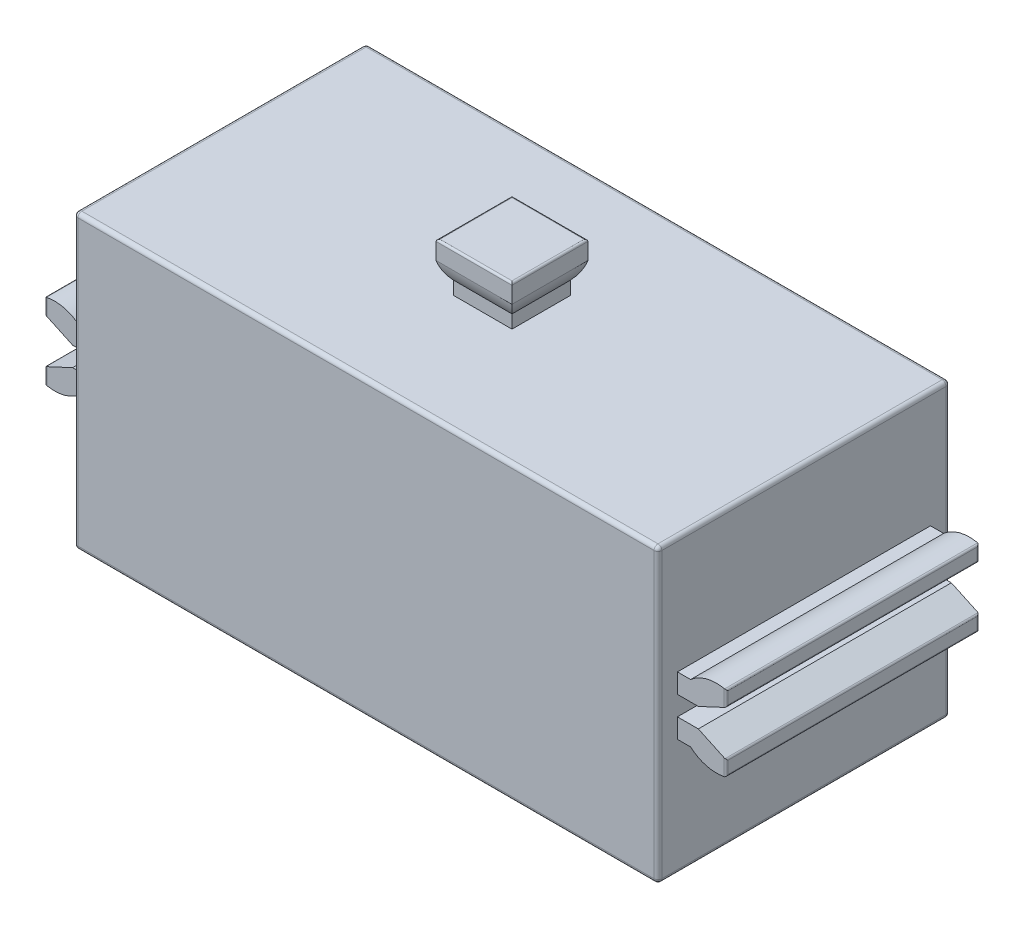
ISO-10303-21;
HEADER;
FILE_DESCRIPTION(('STEP AP214'),'2;1');
FILE_NAME('part.step','',(''),(''),'','','');
FILE_SCHEMA(('AUTOMOTIVE_DESIGN { 1 0 10303 214 1 1 1 1 }'));
ENDSEC;
DATA;
#1=APPLICATION_CONTEXT('core data for automotive mechanical design processes');
#2=APPLICATION_PROTOCOL_DEFINITION('international standard','automotive_design',2000,#1);
#3=PRODUCT_CONTEXT('',#1,'mechanical');
#4=PRODUCT('Part','Part','',(#3));
#5=PRODUCT_RELATED_PRODUCT_CATEGORY('part','',(#4));
#6=PRODUCT_DEFINITION_FORMATION('','',#4);
#7=PRODUCT_DEFINITION_CONTEXT('part definition',#1,'design');
#8=PRODUCT_DEFINITION('design','',#6,#7);
#9=PRODUCT_DEFINITION_SHAPE('','',#8);
#10=(LENGTH_UNIT() NAMED_UNIT(*) SI_UNIT(.MILLI.,.METRE.));
#11=(NAMED_UNIT(*) PLANE_ANGLE_UNIT() SI_UNIT($,.RADIAN.));
#12=(NAMED_UNIT(*) SI_UNIT($,.STERADIAN.) SOLID_ANGLE_UNIT());
#13=UNCERTAINTY_MEASURE_WITH_UNIT(LENGTH_MEASURE(1.E-05),#10,'distance_accuracy_value','');
#14=(GEOMETRIC_REPRESENTATION_CONTEXT(3) GLOBAL_UNCERTAINTY_ASSIGNED_CONTEXT((#13)) GLOBAL_UNIT_ASSIGNED_CONTEXT((#10,
#11,#12)) REPRESENTATION_CONTEXT('',''));
#15=CARTESIAN_POINT('',(0.,0.,0.));
#16=DIRECTION('',(0.,0.,1.));
#17=DIRECTION('',(1.,0.,0.));
#18=AXIS2_PLACEMENT_3D('',#15,#16,#17);
#19=CARTESIAN_POINT('',(-15.,-7.5,-7.5));
#20=DIRECTION('',(0.,-1.,0.));
#21=DIRECTION('',(0.,0.,-1.));
#22=AXIS2_PLACEMENT_3D('',#19,#20,#21);
#23=PLANE('',#22);
#24=DIRECTION('',(1.,0.,0.));
#25=VECTOR('',#24,1.);
#26=CARTESIAN_POINT('',(-15.,-7.5,7.3));
#27=LINE('',#26,#25);
#28=CARTESIAN_POINT('',(14.8,-7.5,7.3));
#29=VERTEX_POINT('',#28);
#30=CARTESIAN_POINT('',(-14.8,-7.5,7.3));
#31=VERTEX_POINT('',#30);
#32=EDGE_CURVE('E895',#29,#31,#27,.F.);
#33=ORIENTED_EDGE('',*,*,#32,.T.);
#34=DIRECTION('',(0.,0.,1.));
#35=VECTOR('',#34,1.);
#36=CARTESIAN_POINT('',(-14.8,-7.5,-7.5));
#37=LINE('',#36,#35);
#38=CARTESIAN_POINT('',(-14.8,-7.5,-7.3));
#39=VERTEX_POINT('',#38);
#40=EDGE_CURVE('E900',#31,#39,#37,.F.);
#41=ORIENTED_EDGE('',*,*,#40,.T.);
#42=DIRECTION('',(1.,0.,0.));
#43=VECTOR('',#42,1.);
#44=CARTESIAN_POINT('',(-15.,-7.5,-7.3));
#45=LINE('',#44,#43);
#46=CARTESIAN_POINT('',(14.8,-7.5,-7.3));
#47=VERTEX_POINT('',#46);
#48=EDGE_CURVE('E897',#39,#47,#45,.T.);
#49=ORIENTED_EDGE('',*,*,#48,.T.);
#50=DIRECTION('',(0.,0.,1.));
#51=VECTOR('',#50,1.);
#52=CARTESIAN_POINT('',(14.8,-7.5,-7.5));
#53=LINE('',#52,#51);
#54=EDGE_CURVE('E843',#47,#29,#53,.T.);
#55=ORIENTED_EDGE('',*,*,#54,.T.);
#56=EDGE_LOOP('',(#33,#41,#49,#55));
#57=FACE_BOUND('',#56,.T.);
#58=CARTESIAN_POINT('',(-2.8,-7.5,0.));
#59=DIRECTION('',(0.,-1.,0.));
#60=DIRECTION('',(0.,0.,-1.));
#61=AXIS2_PLACEMENT_3D('',#58,#59,#60);
#62=CIRCLE('',#61,1.7);
#63=CARTESIAN_POINT('',(-2.8,-7.5,-1.7));
#64=VERTEX_POINT('',#63);
#65=EDGE_CURVE('E1294',#64,#64,#62,.T.);
#66=ORIENTED_EDGE('',*,*,#65,.F.);
#67=EDGE_LOOP('',(#66));
#68=FACE_BOUND('',#67,.T.);
#69=CARTESIAN_POINT('',(2.8,-7.5,0.));
#70=DIRECTION('',(0.,1.,0.));
#71=DIRECTION('',(0.,0.,-1.));
#72=AXIS2_PLACEMENT_3D('',#69,#70,#71);
#73=CIRCLE('',#72,1.7);
#74=CARTESIAN_POINT('',(2.8,-7.5,-1.7));
#75=VERTEX_POINT('',#74);
#76=EDGE_CURVE('E1295',#75,#75,#73,.T.);
#77=ORIENTED_EDGE('',*,*,#76,.T.);
#78=EDGE_LOOP('',(#77));
#79=FACE_BOUND('',#78,.T.);
#80=ADVANCED_FACE('F36',(#57,#68,#79),#23,.T.);
#81=CARTESIAN_POINT('',(-15.,7.5,-7.5));
#82=DIRECTION('',(0.,1.,0.));
#83=DIRECTION('',(0.,0.,1.));
#84=AXIS2_PLACEMENT_3D('',#81,#82,#83);
#85=PLANE('',#84);
#86=DIRECTION('',(-1.,0.,0.));
#87=VECTOR('',#86,1.);
#88=CARTESIAN_POINT('',(-15.,7.5,-7.3));
#89=LINE('',#88,#87);
#90=CARTESIAN_POINT('',(14.8,7.5,-7.3));
#91=VERTEX_POINT('',#90);
#92=CARTESIAN_POINT('',(-14.8,7.5,-7.3));
#93=VERTEX_POINT('',#92);
#94=EDGE_CURVE('E924',#91,#93,#89,.T.);
#95=ORIENTED_EDGE('',*,*,#94,.T.);
#96=DIRECTION('',(0.,0.,1.));
#97=VECTOR('',#96,1.);
#98=CARTESIAN_POINT('',(-14.8,7.5,-7.5));
#99=LINE('',#98,#97);
#100=CARTESIAN_POINT('',(-14.8,7.5,7.3));
#101=VERTEX_POINT('',#100);
#102=EDGE_CURVE('E927',#93,#101,#99,.T.);
#103=ORIENTED_EDGE('',*,*,#102,.T.);
#104=DIRECTION('',(-1.,0.,0.));
#105=VECTOR('',#104,1.);
#106=CARTESIAN_POINT('',(15.,7.5,7.3));
#107=LINE('',#106,#105);
#108=CARTESIAN_POINT('',(14.8,7.5,7.3));
#109=VERTEX_POINT('',#108);
#110=EDGE_CURVE('E922',#101,#109,#107,.F.);
#111=ORIENTED_EDGE('',*,*,#110,.T.);
#112=DIRECTION('',(0.,0.,1.));
#113=VECTOR('',#112,1.);
#114=CARTESIAN_POINT('',(14.8,7.5,-7.5));
#115=LINE('',#114,#113);
#116=EDGE_CURVE('E920',#109,#91,#115,.F.);
#117=ORIENTED_EDGE('',*,*,#116,.T.);
#118=EDGE_LOOP('',(#95,#103,#111,#117));
#119=FACE_BOUND('',#118,.T.);
#120=DIRECTION('',(1.,0.,0.));
#121=VECTOR('',#120,1.);
#122=CARTESIAN_POINT('',(-1.5,7.5,1.5));
#123=LINE('',#122,#121);
#124=CARTESIAN_POINT('',(-1.5,7.5,1.5));
#125=VERTEX_POINT('',#124);
#126=CARTESIAN_POINT('',(1.5,7.5,1.5));
#127=VERTEX_POINT('',#126);
#128=EDGE_CURVE('E1332',#125,#127,#123,.T.);
#129=ORIENTED_EDGE('',*,*,#128,.F.);
#130=DIRECTION('',(0.,0.,1.));
#131=VECTOR('',#130,1.);
#132=CARTESIAN_POINT('',(-1.5,7.5,-1.5));
#133=LINE('',#132,#131);
#134=CARTESIAN_POINT('',(-1.5,7.5,-1.5));
#135=VERTEX_POINT('',#134);
#136=EDGE_CURVE('E1330',#135,#125,#133,.T.);
#137=ORIENTED_EDGE('',*,*,#136,.F.);
#138=DIRECTION('',(-1.,0.,0.));
#139=VECTOR('',#138,1.);
#140=CARTESIAN_POINT('',(-1.5,7.5,-1.5));
#141=LINE('',#140,#139);
#142=CARTESIAN_POINT('',(1.5,7.5,-1.5));
#143=VERTEX_POINT('',#142);
#144=EDGE_CURVE('E462',#143,#135,#141,.T.);
#145=ORIENTED_EDGE('',*,*,#144,.F.);
#146=DIRECTION('',(0.,0.,-1.));
#147=VECTOR('',#146,1.);
#148=CARTESIAN_POINT('',(1.5,7.5,-1.5));
#149=LINE('',#148,#147);
#150=EDGE_CURVE('E468',#127,#143,#149,.T.);
#151=ORIENTED_EDGE('',*,*,#150,.F.);
#152=EDGE_LOOP('',(#129,#137,#145,#151));
#153=FACE_BOUND('',#152,.T.);
#154=ADVANCED_FACE('F1055',(#119,#153),#85,.T.);
#155=CARTESIAN_POINT('',(-15.,-7.5,-7.5));
#156=DIRECTION('',(-1.,0.,0.));
#157=DIRECTION('',(0.,0.,1.));
#158=AXIS2_PLACEMENT_3D('',#155,#156,#157);
#159=PLANE('',#158);
#160=DIRECTION('',(0.,-1.,0.));
#161=VECTOR('',#160,1.);
#162=CARTESIAN_POINT('',(-15.,-7.5,-7.3));
#163=LINE('',#162,#161);
#164=CARTESIAN_POINT('',(-15.,7.3,-7.3));
#165=VERTEX_POINT('',#164);
#166=CARTESIAN_POINT('',(-15.,-7.3,-7.3));
#167=VERTEX_POINT('',#166);
#168=EDGE_CURVE('E933',#165,#167,#163,.T.);
#169=ORIENTED_EDGE('',*,*,#168,.T.);
#170=DIRECTION('',(0.,0.,1.));
#171=VECTOR('',#170,1.);
#172=CARTESIAN_POINT('',(-15.,-7.3,-7.5));
#173=LINE('',#172,#171);
#174=CARTESIAN_POINT('',(-15.,-7.3,7.3));
#175=VERTEX_POINT('',#174);
#176=EDGE_CURVE('E936',#167,#175,#173,.T.);
#177=ORIENTED_EDGE('',*,*,#176,.T.);
#178=DIRECTION('',(0.,-1.,0.));
#179=VECTOR('',#178,1.);
#180=CARTESIAN_POINT('',(-15.,7.5,7.3));
#181=LINE('',#180,#179);
#182=CARTESIAN_POINT('',(-15.,7.3,7.3));
#183=VERTEX_POINT('',#182);
#184=EDGE_CURVE('E931',#175,#183,#181,.F.);
#185=ORIENTED_EDGE('',*,*,#184,.T.);
#186=DIRECTION('',(0.,0.,1.));
#187=VECTOR('',#186,1.);
#188=CARTESIAN_POINT('',(-15.,7.3,-7.5));
#189=LINE('',#188,#187);
#190=EDGE_CURVE('E929',#183,#165,#189,.F.);
#191=ORIENTED_EDGE('',*,*,#190,.T.);
#192=EDGE_LOOP('',(#169,#177,#185,#191));
#193=FACE_BOUND('',#192,.T.);
#194=DIRECTION('',(0.,0.,1.));
#195=VECTOR('',#194,1.);
#196=CARTESIAN_POINT('',(-15.,-1.5,-6.5));
#197=LINE('',#196,#195);
#198=CARTESIAN_POINT('',(-15.,-1.5,-6.5));
#199=VERTEX_POINT('',#198);
#200=CARTESIAN_POINT('',(-15.,-1.5,6.5));
#201=VERTEX_POINT('',#200);
#202=EDGE_CURVE('E615',#199,#201,#197,.T.);
#203=ORIENTED_EDGE('',*,*,#202,.F.);
#204=DIRECTION('',(0.,1.,0.));
#205=VECTOR('',#204,1.);
#206=CARTESIAN_POINT('',(-15.,-0.5,-6.5));
#207=LINE('',#206,#205);
#208=CARTESIAN_POINT('',(-15.,-0.5,-6.5));
#209=VERTEX_POINT('',#208);
#210=EDGE_CURVE('E599',#199,#209,#207,.T.);
#211=ORIENTED_EDGE('',*,*,#210,.T.);
#212=DIRECTION('',(0.,0.,1.));
#213=VECTOR('',#212,1.);
#214=CARTESIAN_POINT('',(-15.,-0.5,-6.5));
#215=LINE('',#214,#213);
#216=CARTESIAN_POINT('',(-15.,-0.5,6.5));
#217=VERTEX_POINT('',#216);
#218=EDGE_CURVE('E437',#209,#217,#215,.T.);
#219=ORIENTED_EDGE('',*,*,#218,.T.);
#220=DIRECTION('',(0.,1.,0.));
#221=VECTOR('',#220,1.);
#222=CARTESIAN_POINT('',(-15.,-0.5,6.5));
#223=LINE('',#222,#221);
#224=EDGE_CURVE('E591',#201,#217,#223,.T.);
#225=ORIENTED_EDGE('',*,*,#224,.F.);
#226=EDGE_LOOP('',(#203,#211,#219,#225));
#227=FACE_BOUND('',#226,.T.);
#228=DIRECTION('',(0.,0.,1.));
#229=VECTOR('',#228,1.);
#230=CARTESIAN_POINT('',(-15.,0.5,-6.5));
#231=LINE('',#230,#229);
#232=CARTESIAN_POINT('',(-15.,0.5,-6.5));
#233=VERTEX_POINT('',#232);
#234=CARTESIAN_POINT('',(-15.,0.5,6.5));
#235=VERTEX_POINT('',#234);
#236=EDGE_CURVE('E577',#233,#235,#231,.T.);
#237=ORIENTED_EDGE('',*,*,#236,.F.);
#238=DIRECTION('',(0.,1.,0.));
#239=VECTOR('',#238,1.);
#240=CARTESIAN_POINT('',(-15.,1.5,-6.5));
#241=LINE('',#240,#239);
#242=CARTESIAN_POINT('',(-15.,1.5,-6.5));
#243=VERTEX_POINT('',#242);
#244=EDGE_CURVE('E550',#233,#243,#241,.T.);
#245=ORIENTED_EDGE('',*,*,#244,.T.);
#246=DIRECTION('',(0.,0.,1.));
#247=VECTOR('',#246,1.);
#248=CARTESIAN_POINT('',(-15.,1.5,-6.5));
#249=LINE('',#248,#247);
#250=CARTESIAN_POINT('',(-15.,1.5,6.5));
#251=VERTEX_POINT('',#250);
#252=EDGE_CURVE('E564',#243,#251,#249,.T.);
#253=ORIENTED_EDGE('',*,*,#252,.T.);
#254=DIRECTION('',(0.,1.,0.));
#255=VECTOR('',#254,1.);
#256=CARTESIAN_POINT('',(-15.,1.5,6.5));
#257=LINE('',#256,#255);
#258=EDGE_CURVE('E541',#235,#251,#257,.T.);
#259=ORIENTED_EDGE('',*,*,#258,.F.);
#260=EDGE_LOOP('',(#237,#245,#253,#259));
#261=FACE_BOUND('',#260,.T.);
#262=ADVANCED_FACE('F1024',(#193,#227,#261),#159,.T.);
#263=CARTESIAN_POINT('',(15.,-7.5,-7.5));
#264=DIRECTION('',(1.,0.,0.));
#265=DIRECTION('',(0.,0.,-1.));
#266=AXIS2_PLACEMENT_3D('',#263,#264,#265);
#267=PLANE('',#266);
#268=DIRECTION('',(0.,1.,0.));
#269=VECTOR('',#268,1.);
#270=CARTESIAN_POINT('',(15.,-7.5,-7.3));
#271=LINE('',#270,#269);
#272=CARTESIAN_POINT('',(15.,-7.3,-7.3));
#273=VERTEX_POINT('',#272);
#274=CARTESIAN_POINT('',(15.,7.3,-7.3));
#275=VERTEX_POINT('',#274);
#276=EDGE_CURVE('E915',#273,#275,#271,.T.);
#277=ORIENTED_EDGE('',*,*,#276,.T.);
#278=DIRECTION('',(0.,0.,1.));
#279=VECTOR('',#278,1.);
#280=CARTESIAN_POINT('',(15.,7.3,-7.5));
#281=LINE('',#280,#279);
#282=CARTESIAN_POINT('',(15.,7.3,7.3));
#283=VERTEX_POINT('',#282);
#284=EDGE_CURVE('E918',#275,#283,#281,.T.);
#285=ORIENTED_EDGE('',*,*,#284,.T.);
#286=DIRECTION('',(0.,1.,0.));
#287=VECTOR('',#286,1.);
#288=CARTESIAN_POINT('',(15.,-7.5,7.3));
#289=LINE('',#288,#287);
#290=CARTESIAN_POINT('',(15.,-7.3,7.3));
#291=VERTEX_POINT('',#290);
#292=EDGE_CURVE('E913',#283,#291,#289,.F.);
#293=ORIENTED_EDGE('',*,*,#292,.T.);
#294=DIRECTION('',(0.,0.,1.));
#295=VECTOR('',#294,1.);
#296=CARTESIAN_POINT('',(15.,-7.3,-7.5));
#297=LINE('',#296,#295);
#298=EDGE_CURVE('E911',#291,#273,#297,.F.);
#299=ORIENTED_EDGE('',*,*,#298,.T.);
#300=EDGE_LOOP('',(#277,#285,#293,#299));
#301=FACE_BOUND('',#300,.T.);
#302=DIRECTION('',(0.,-1.,0.));
#303=VECTOR('',#302,1.);
#304=CARTESIAN_POINT('',(15.,1.5,-6.5));
#305=LINE('',#304,#303);
#306=CARTESIAN_POINT('',(15.,1.5,-6.5));
#307=VERTEX_POINT('',#306);
#308=CARTESIAN_POINT('',(15.,0.5,-6.5));
#309=VERTEX_POINT('',#308);
#310=EDGE_CURVE('E481',#307,#309,#305,.T.);
#311=ORIENTED_EDGE('',*,*,#310,.T.);
#312=DIRECTION('',(0.,0.,1.));
#313=VECTOR('',#312,1.);
#314=CARTESIAN_POINT('',(15.,0.5,-6.5));
#315=LINE('',#314,#313);
#316=CARTESIAN_POINT('',(15.,0.5,6.5));
#317=VERTEX_POINT('',#316);
#318=EDGE_CURVE('E505',#309,#317,#315,.T.);
#319=ORIENTED_EDGE('',*,*,#318,.T.);
#320=DIRECTION('',(0.,-1.,0.));
#321=VECTOR('',#320,1.);
#322=CARTESIAN_POINT('',(15.,1.5,6.5));
#323=LINE('',#322,#321);
#324=CARTESIAN_POINT('',(15.,1.5,6.5));
#325=VERTEX_POINT('',#324);
#326=EDGE_CURVE('E494',#325,#317,#323,.T.);
#327=ORIENTED_EDGE('',*,*,#326,.F.);
#328=DIRECTION('',(0.,0.,1.));
#329=VECTOR('',#328,1.);
#330=CARTESIAN_POINT('',(15.,1.5,-6.5));
#331=LINE('',#330,#329);
#332=EDGE_CURVE('E508',#307,#325,#331,.T.);
#333=ORIENTED_EDGE('',*,*,#332,.F.);
#334=EDGE_LOOP('',(#311,#319,#327,#333));
#335=FACE_BOUND('',#334,.T.);
#336=DIRECTION('',(0.,-1.,0.));
#337=VECTOR('',#336,1.);
#338=CARTESIAN_POINT('',(15.,-0.5,-6.5));
#339=LINE('',#338,#337);
#340=CARTESIAN_POINT('',(15.,-0.5,-6.5));
#341=VERTEX_POINT('',#340);
#342=CARTESIAN_POINT('',(15.,-1.5,-6.5));
#343=VERTEX_POINT('',#342);
#344=EDGE_CURVE('E522',#341,#343,#339,.T.);
#345=ORIENTED_EDGE('',*,*,#344,.T.);
#346=DIRECTION('',(0.,0.,1.));
#347=VECTOR('',#346,1.);
#348=CARTESIAN_POINT('',(15.,-1.5,-6.5));
#349=LINE('',#348,#347);
#350=CARTESIAN_POINT('',(15.,-1.5,6.5));
#351=VERTEX_POINT('',#350);
#352=EDGE_CURVE('E542',#343,#351,#349,.T.);
#353=ORIENTED_EDGE('',*,*,#352,.T.);
#354=DIRECTION('',(0.,-1.,0.));
#355=VECTOR('',#354,1.);
#356=CARTESIAN_POINT('',(15.,-0.5,6.5));
#357=LINE('',#356,#355);
#358=CARTESIAN_POINT('',(15.,-0.5,6.5));
#359=VERTEX_POINT('',#358);
#360=EDGE_CURVE('E535',#359,#351,#357,.T.);
#361=ORIENTED_EDGE('',*,*,#360,.F.);
#362=DIRECTION('',(0.,0.,1.));
#363=VECTOR('',#362,1.);
#364=CARTESIAN_POINT('',(15.,-0.5,-6.5));
#365=LINE('',#364,#363);
#366=EDGE_CURVE('E545',#341,#359,#365,.T.);
#367=ORIENTED_EDGE('',*,*,#366,.F.);
#368=EDGE_LOOP('',(#345,#353,#361,#367));
#369=FACE_BOUND('',#368,.T.);
#370=ADVANCED_FACE('F1095',(#301,#335,#369),#267,.T.);
#371=CARTESIAN_POINT('',(-15.,7.5,-7.5));
#372=DIRECTION('',(0.,0.,-1.));
#373=DIRECTION('',(-1.,0.,0.));
#374=AXIS2_PLACEMENT_3D('',#371,#372,#373);
#375=PLANE('',#374);
#376=DIRECTION('',(0.,1.,0.));
#377=VECTOR('',#376,1.);
#378=CARTESIAN_POINT('',(14.8,7.5,-7.5));
#379=LINE('',#378,#377);
#380=CARTESIAN_POINT('',(14.8,7.3,-7.5));
#381=VERTEX_POINT('',#380);
#382=CARTESIAN_POINT('',(14.8,-7.3,-7.5));
#383=VERTEX_POINT('',#382);
#384=EDGE_CURVE('E906',#381,#383,#379,.F.);
#385=ORIENTED_EDGE('',*,*,#384,.T.);
#386=DIRECTION('',(1.,0.,0.));
#387=VECTOR('',#386,1.);
#388=CARTESIAN_POINT('',(-15.,-7.3,-7.5));
#389=LINE('',#388,#387);
#390=CARTESIAN_POINT('',(-14.8,-7.3,-7.5));
#391=VERTEX_POINT('',#390);
#392=EDGE_CURVE('E908',#383,#391,#389,.F.);
#393=ORIENTED_EDGE('',*,*,#392,.T.);
#394=DIRECTION('',(0.,-1.,0.));
#395=VECTOR('',#394,1.);
#396=CARTESIAN_POINT('',(-14.8,7.5,-7.5));
#397=LINE('',#396,#395);
#398=CARTESIAN_POINT('',(-14.8,7.3,-7.5));
#399=VERTEX_POINT('',#398);
#400=EDGE_CURVE('E902',#391,#399,#397,.F.);
#401=ORIENTED_EDGE('',*,*,#400,.T.);
#402=DIRECTION('',(-1.,0.,0.));
#403=VECTOR('',#402,1.);
#404=CARTESIAN_POINT('',(-15.,7.3,-7.5));
#405=LINE('',#404,#403);
#406=EDGE_CURVE('E904',#399,#381,#405,.F.);
#407=ORIENTED_EDGE('',*,*,#406,.T.);
#408=EDGE_LOOP('',(#385,#393,#401,#407));
#409=FACE_BOUND('',#408,.T.);
#410=ADVANCED_FACE('F1100',(#409),#375,.T.);
#411=CARTESIAN_POINT('',(-15.,7.5,7.5));
#412=DIRECTION('',(0.,0.,-1.));
#413=DIRECTION('',(-1.,0.,0.));
#414=AXIS2_PLACEMENT_3D('',#411,#412,#413);
#415=PLANE('',#414);
#416=DIRECTION('',(0.,1.,0.));
#417=VECTOR('',#416,1.);
#418=CARTESIAN_POINT('',(14.8,7.5,7.5));
#419=LINE('',#418,#417);
#420=CARTESIAN_POINT('',(14.8,-7.3,7.5));
#421=VERTEX_POINT('',#420);
#422=CARTESIAN_POINT('',(14.8,7.3,7.5));
#423=VERTEX_POINT('',#422);
#424=EDGE_CURVE('E45',#421,#423,#419,.T.);
#425=ORIENTED_EDGE('',*,*,#424,.T.);
#426=DIRECTION('',(-1.,0.,0.));
#427=VECTOR('',#426,1.);
#428=CARTESIAN_POINT('',(-15.,7.3,7.5));
#429=LINE('',#428,#427);
#430=CARTESIAN_POINT('',(-14.8,7.3,7.5));
#431=VERTEX_POINT('',#430);
#432=EDGE_CURVE('E11',#423,#431,#429,.T.);
#433=ORIENTED_EDGE('',*,*,#432,.T.);
#434=DIRECTION('',(0.,-1.,0.));
#435=VECTOR('',#434,1.);
#436=CARTESIAN_POINT('',(-14.8,-7.5,7.5));
#437=LINE('',#436,#435);
#438=CARTESIAN_POINT('',(-14.8,-7.3,7.5));
#439=VERTEX_POINT('',#438);
#440=EDGE_CURVE('E938',#431,#439,#437,.T.);
#441=ORIENTED_EDGE('',*,*,#440,.T.);
#442=DIRECTION('',(1.,0.,0.));
#443=VECTOR('',#442,1.);
#444=CARTESIAN_POINT('',(15.,-7.3,7.5));
#445=LINE('',#444,#443);
#446=EDGE_CURVE('E56',#439,#421,#445,.T.);
#447=ORIENTED_EDGE('',*,*,#446,.T.);
#448=EDGE_LOOP('',(#425,#433,#441,#447));
#449=FACE_BOUND('',#448,.T.);
#450=ADVANCED_FACE('F1032',(#449),#415,.F.);
#451=CARTESIAN_POINT('',(-15.,-0.5,-6.5));
#452=DIRECTION('',(0.,1.,0.));
#453=DIRECTION('',(-1.,0.,0.));
#454=AXIS2_PLACEMENT_3D('',#451,#452,#453);
#455=PLANE('',#454);
#456=DIRECTION('',(-1.,0.,0.));
#457=VECTOR('',#456,1.);
#458=CARTESIAN_POINT('',(-15.,-0.5,6.5));
#459=LINE('',#458,#457);
#460=CARTESIAN_POINT('',(-16.0722534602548,-0.5,6.5));
#461=VERTEX_POINT('',#460);
#462=EDGE_CURVE('E580',#217,#461,#459,.T.);
#463=ORIENTED_EDGE('',*,*,#462,.F.);
#464=ORIENTED_EDGE('',*,*,#218,.F.);
#465=DIRECTION('',(-1.,0.,0.));
#466=VECTOR('',#465,1.);
#467=CARTESIAN_POINT('',(-15.,-0.5,-6.5));
#468=LINE('',#467,#466);
#469=CARTESIAN_POINT('',(-16.0722534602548,-0.5,-6.5));
#470=VERTEX_POINT('',#469);
#471=EDGE_CURVE('E587',#209,#470,#468,.T.);
#472=ORIENTED_EDGE('',*,*,#471,.T.);
#473=DIRECTION('',(0.,0.,1.));
#474=VECTOR('',#473,1.);
#475=CARTESIAN_POINT('',(-16.0722534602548,-0.5,-6.5));
#476=LINE('',#475,#474);
#477=EDGE_CURVE('E601',#470,#461,#476,.T.);
#478=ORIENTED_EDGE('',*,*,#477,.T.);
#479=EDGE_LOOP('',(#463,#464,#472,#478));
#480=FACE_BOUND('',#479,.T.);
#481=ADVANCED_FACE('F1913',(#480),#455,.T.);
#482=CARTESIAN_POINT('',(-15.6771243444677,-1.5,-6.5));
#483=DIRECTION('',(0.,-1.,0.));
#484=DIRECTION('',(1.,0.,0.));
#485=AXIS2_PLACEMENT_3D('',#482,#483,#484);
#486=PLANE('',#485);
#487=DIRECTION('',(1.,0.,0.));
#488=VECTOR('',#487,1.);
#489=CARTESIAN_POINT('',(-15.6771243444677,-1.5,6.5));
#490=LINE('',#489,#488);
#491=CARTESIAN_POINT('',(-15.6771243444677,-1.5,6.5));
#492=VERTEX_POINT('',#491);
#493=EDGE_CURVE('E609',#492,#201,#490,.T.);
#494=ORIENTED_EDGE('',*,*,#493,.F.);
#495=DIRECTION('',(0.,0.,1.));
#496=VECTOR('',#495,1.);
#497=CARTESIAN_POINT('',(-15.6771243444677,-1.5,-6.5));
#498=LINE('',#497,#496);
#499=CARTESIAN_POINT('',(-15.6771243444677,-1.5,-6.5));
#500=VERTEX_POINT('',#499);
#501=EDGE_CURVE('E618',#500,#492,#498,.T.);
#502=ORIENTED_EDGE('',*,*,#501,.F.);
#503=DIRECTION('',(1.,0.,0.));
#504=VECTOR('',#503,1.);
#505=CARTESIAN_POINT('',(-15.6771243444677,-1.5,-6.5));
#506=LINE('',#505,#504);
#507=EDGE_CURVE('E596',#500,#199,#506,.T.);
#508=ORIENTED_EDGE('',*,*,#507,.T.);
#509=ORIENTED_EDGE('',*,*,#202,.T.);
#510=EDGE_LOOP('',(#494,#502,#508,#509));
#511=FACE_BOUND('',#510,.T.);
#512=ADVANCED_FACE('F1906',(#511),#486,.T.);
#513=CARTESIAN_POINT('',(-17.,0.,-6.5));
#514=DIRECTION('',(0.,0.,1.));
#515=DIRECTION('',(1.,0.,0.));
#516=AXIS2_PLACEMENT_3D('',#513,#514,#515);
#517=CYLINDRICAL_SURFACE('',#516,2.);
#518=DIRECTION('',(0.,0.,1.));
#519=VECTOR('',#518,1.);
#520=CARTESIAN_POINT('',(-17.4210526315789,-1.9551763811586,-6.5));
#521=LINE('',#520,#519);
#522=CARTESIAN_POINT('',(-17.4210526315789,-1.9551763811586,6.4977588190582));
#523=VERTEX_POINT('',#522);
#524=CARTESIAN_POINT('',(-17.4210526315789,-1.9551763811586,-6.4977588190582));
#525=VERTEX_POINT('',#524);
#526=EDGE_CURVE('E637',#523,#525,#521,.F.);
#527=ORIENTED_EDGE('',*,*,#526,.T.);
#528=CARTESIAN_POINT('',(-17.4210526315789,-1.9551763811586,-6.4977588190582));
#529=CARTESIAN_POINT('',(-17.4175857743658,-1.95592319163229,-6.49850458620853));
#530=CARTESIAN_POINT('',(-17.4140979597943,-1.95666454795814,-6.4990642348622));
#531=CARTESIAN_POINT('',(-17.4070804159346,-1.95813635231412,-6.49981129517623));
#532=CARTESIAN_POINT('',(-17.4035506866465,-1.95886680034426,-6.49999870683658));
#533=CARTESIAN_POINT('',(-17.4000000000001,-1.95959179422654,-6.50000000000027));
#534=B_SPLINE_CURVE_WITH_KNOTS('',3,(#528,#529,#530,#531,#532,#533),.UNSPECIFIED.,.F.,.F.,(4,2,
4),(0.,0.0108281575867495,0.0216563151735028),.UNSPECIFIED.);
#535=CARTESIAN_POINT('',(-17.4,-1.95959179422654,-6.5));
#536=VERTEX_POINT('',#535);
#537=EDGE_CURVE('E658',#525,#536,#534,.T.);
#538=ORIENTED_EDGE('',*,*,#537,.T.);
#539=CARTESIAN_POINT('',(-17.,0.,-6.5));
#540=DIRECTION('',(0.,0.,1.));
#541=DIRECTION('',(1.,0.,0.));
#542=AXIS2_PLACEMENT_3D('',#539,#540,#541);
#543=CIRCLE('',#542,2.);
#544=EDGE_CURVE('E594',#536,#500,#543,.T.);
#545=ORIENTED_EDGE('',*,*,#544,.T.);
#546=ORIENTED_EDGE('',*,*,#501,.T.);
#547=CARTESIAN_POINT('',(-17.,0.,6.5));
#548=DIRECTION('',(0.,0.,1.));
#549=DIRECTION('',(1.,0.,0.));
#550=AXIS2_PLACEMENT_3D('',#547,#548,#549);
#551=CIRCLE('',#550,2.);
#552=CARTESIAN_POINT('',(-17.4,-1.95959179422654,6.5));
#553=VERTEX_POINT('',#552);
#554=EDGE_CURVE('E607',#553,#492,#551,.T.);
#555=ORIENTED_EDGE('',*,*,#554,.F.);
#556=CARTESIAN_POINT('',(-17.4,-1.95959179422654,6.5));
#557=CARTESIAN_POINT('',(-17.4035506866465,-1.95886680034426,6.49999870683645));
#558=CARTESIAN_POINT('',(-17.4070804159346,-1.95813635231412,6.49981129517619));
#559=CARTESIAN_POINT('',(-17.4140979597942,-1.95666454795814,6.49906423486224));
#560=CARTESIAN_POINT('',(-17.4175857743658,-1.9559231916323,6.49850458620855));
#561=CARTESIAN_POINT('',(-17.4210526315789,-1.9551763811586,6.49775881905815));
#562=B_SPLINE_CURVE_WITH_KNOTS('',3,(#556,#557,#558,#559,#560,#561),.UNSPECIFIED.,.F.,.F.,(4,2,
4),(0.,0.0108281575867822,0.0216563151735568),.UNSPECIFIED.);
#563=EDGE_CURVE('E630',#553,#523,#562,.T.);
#564=ORIENTED_EDGE('',*,*,#563,.T.);
#565=EDGE_LOOP('',(#527,#538,#545,#546,#555,#564));
#566=FACE_BOUND('',#565,.T.);
#567=ADVANCED_FACE('F639',(#566),#517,.T.);
#568=CARTESIAN_POINT('',(-17.5,-1.16576914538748,-6.5));
#569=DIRECTION('',(-1.,0.,0.));
#570=DIRECTION('',(0.,0.,1.));
#571=AXIS2_PLACEMENT_3D('',#568,#569,#570);
#572=PLANE('',#571);
#573=DIRECTION('',(0.,-1.,0.));
#574=VECTOR('',#573,1.);
#575=CARTESIAN_POINT('',(-17.5,-1.93649167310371,-6.4));
#576=LINE('',#575,#574);
#577=CARTESIAN_POINT('',(-17.5,-1.22947617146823,-6.4));
#578=VERTEX_POINT('',#577);
#579=CARTESIAN_POINT('',(-17.5,-1.85741756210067,-6.4));
#580=VERTEX_POINT('',#579);
#581=EDGE_CURVE('E625',#578,#580,#576,.T.);
#582=ORIENTED_EDGE('',*,*,#581,.T.);
#583=DIRECTION('',(0.,0.,1.));
#584=VECTOR('',#583,1.);
#585=CARTESIAN_POINT('',(-17.5,-1.85741756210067,-6.5));
#586=LINE('',#585,#584);
#587=CARTESIAN_POINT('',(-17.5,-1.85741756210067,6.4));
#588=VERTEX_POINT('',#587);
#589=EDGE_CURVE('E627',#580,#588,#586,.T.);
#590=ORIENTED_EDGE('',*,*,#589,.T.);
#591=DIRECTION('',(0.,-1.,0.));
#592=VECTOR('',#591,1.);
#593=CARTESIAN_POINT('',(-17.5,-1.16576914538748,6.4));
#594=LINE('',#593,#592);
#595=CARTESIAN_POINT('',(-17.5,-1.22947617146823,6.4));
#596=VERTEX_POINT('',#595);
#597=EDGE_CURVE('E436',#588,#596,#594,.F.);
#598=ORIENTED_EDGE('',*,*,#597,.T.);
#599=DIRECTION('',(0.,0.,1.));
#600=VECTOR('',#599,1.);
#601=CARTESIAN_POINT('',(-17.5,-1.22947617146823,-6.5));
#602=LINE('',#601,#600);
#603=EDGE_CURVE('E623',#596,#578,#602,.F.);
#604=ORIENTED_EDGE('',*,*,#603,.T.);
#605=EDGE_LOOP('',(#582,#590,#598,#604));
#606=FACE_BOUND('',#605,.T.);
#607=ADVANCED_FACE('F1891',(#606),#572,.T.);
#608=CARTESIAN_POINT('',(-16.0722534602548,-0.5,-6.5));
#609=DIRECTION('',(-0.422618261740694,0.906307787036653,0.));
#610=DIRECTION('',(-0.906307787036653,-0.422618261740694,0.));
#611=AXIS2_PLACEMENT_3D('',#608,#609,#610);
#612=PLANE('',#611);
#613=DIRECTION('',(-0.906307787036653,-0.422618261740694,0.));
#614=VECTOR('',#613,1.);
#615=CARTESIAN_POINT('',(-16.0722534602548,-0.5,-6.5));
#616=LINE('',#615,#614);
#617=CARTESIAN_POINT('',(-17.4,-1.11913837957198,-6.5));
#618=VERTEX_POINT('',#617);
#619=EDGE_CURVE('E590',#470,#618,#616,.T.);
#620=ORIENTED_EDGE('',*,*,#619,.T.);
#621=CARTESIAN_POINT('',(-17.4,-1.11913837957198,-6.4));
#622=DIRECTION('',(-0.422618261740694,0.906307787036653,0.));
#623=DIRECTION('',(0.906307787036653,0.422618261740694,0.));
#624=AXIS2_PLACEMENT_3D('',#621,#622,#623);
#625=ELLIPSE('',#624,0.110337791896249,0.1);
#626=CARTESIAN_POINT('',(-17.4422618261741,-1.13884539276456,-6.49063077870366));
#627=VERTEX_POINT('',#626);
#628=EDGE_CURVE('E669',#618,#627,#625,.T.);
#629=ORIENTED_EDGE('',*,*,#628,.T.);
#630=DIRECTION('',(0.,0.,1.));
#631=VECTOR('',#630,1.);
#632=CARTESIAN_POINT('',(-17.4422618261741,-1.13884539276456,-6.5));
#633=LINE('',#632,#631);
#634=CARTESIAN_POINT('',(-17.4422618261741,-1.13884539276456,6.49063077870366));
#635=VERTEX_POINT('',#634);
#636=EDGE_CURVE('E667',#627,#635,#633,.T.);
#637=ORIENTED_EDGE('',*,*,#636,.T.);
#638=CARTESIAN_POINT('',(-17.4,-1.11913837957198,6.4));
#639=DIRECTION('',(-0.422618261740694,0.906307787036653,0.));
#640=DIRECTION('',(-0.906307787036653,-0.422618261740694,0.));
#641=AXIS2_PLACEMENT_3D('',#638,#639,#640);
#642=ELLIPSE('',#641,0.110337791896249,0.1);
#643=CARTESIAN_POINT('',(-17.4,-1.11913837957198,6.5));
#644=VERTEX_POINT('',#643);
#645=EDGE_CURVE('E665',#635,#644,#642,.T.);
#646=ORIENTED_EDGE('',*,*,#645,.T.);
#647=DIRECTION('',(-0.906307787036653,-0.422618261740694,0.));
#648=VECTOR('',#647,1.);
#649=CARTESIAN_POINT('',(-16.0722534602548,-0.5,6.5));
#650=LINE('',#649,#648);
#651=EDGE_CURVE('E604',#461,#644,#650,.T.);
#652=ORIENTED_EDGE('',*,*,#651,.F.);
#653=ORIENTED_EDGE('',*,*,#477,.F.);
#654=EDGE_LOOP('',(#620,#629,#637,#646,#652,#653));
#655=FACE_BOUND('',#654,.T.);
#656=ADVANCED_FACE('F1882',(#655),#612,.T.);
#657=CARTESIAN_POINT('',(-17.,0.,-6.5));
#658=DIRECTION('',(0.,0.,1.));
#659=DIRECTION('',(1.,0.,0.));
#660=AXIS2_PLACEMENT_3D('',#657,#658,#659);
#661=PLANE('',#660);
#662=ORIENTED_EDGE('',*,*,#544,.F.);
#663=DIRECTION('',(0.,-1.,0.));
#664=VECTOR('',#663,1.);
#665=CARTESIAN_POINT('',(-17.4,-1.16576914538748,-6.5));
#666=LINE('',#665,#664);
#667=EDGE_CURVE('E663',#536,#618,#666,.F.);
#668=ORIENTED_EDGE('',*,*,#667,.T.);
#669=ORIENTED_EDGE('',*,*,#619,.F.);
#670=ORIENTED_EDGE('',*,*,#471,.F.);
#671=ORIENTED_EDGE('',*,*,#210,.F.);
#672=ORIENTED_EDGE('',*,*,#507,.F.);
#673=EDGE_LOOP('',(#662,#668,#669,#670,#671,#672));
#674=FACE_BOUND('',#673,.T.);
#675=ADVANCED_FACE('F1873',(#674),#661,.F.);
#676=CARTESIAN_POINT('',(-17.,0.,6.5));
#677=DIRECTION('',(0.,0.,1.));
#678=DIRECTION('',(1.,0.,0.));
#679=AXIS2_PLACEMENT_3D('',#676,#677,#678);
#680=PLANE('',#679);
#681=ORIENTED_EDGE('',*,*,#651,.T.);
#682=DIRECTION('',(0.,-1.,0.));
#683=VECTOR('',#682,1.);
#684=CARTESIAN_POINT('',(-17.4,0.,6.5));
#685=LINE('',#684,#683);
#686=EDGE_CURVE('E671',#644,#553,#685,.T.);
#687=ORIENTED_EDGE('',*,*,#686,.T.);
#688=ORIENTED_EDGE('',*,*,#554,.T.);
#689=ORIENTED_EDGE('',*,*,#493,.T.);
#690=ORIENTED_EDGE('',*,*,#224,.T.);
#691=ORIENTED_EDGE('',*,*,#462,.T.);
#692=EDGE_LOOP('',(#681,#687,#688,#689,#690,#691));
#693=FACE_BOUND('',#692,.T.);
#694=ADVANCED_FACE('F1864',(#693),#680,.T.);
#695=CARTESIAN_POINT('',(-15.,0.5,-6.5));
#696=DIRECTION('',(0.,-1.,0.));
#697=DIRECTION('',(1.,0.,0.));
#698=AXIS2_PLACEMENT_3D('',#695,#696,#697);
#699=PLANE('',#698);
#700=DIRECTION('',(1.,0.,0.));
#701=VECTOR('',#700,1.);
#702=CARTESIAN_POINT('',(-15.,0.5,6.5));
#703=LINE('',#702,#701);
#704=CARTESIAN_POINT('',(-16.0722534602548,0.5,6.5));
#705=VERTEX_POINT('',#704);
#706=EDGE_CURVE('E553',#705,#235,#703,.T.);
#707=ORIENTED_EDGE('',*,*,#706,.F.);
#708=DIRECTION('',(0.,0.,1.));
#709=VECTOR('',#708,1.);
#710=CARTESIAN_POINT('',(-16.0722534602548,0.5,-6.5));
#711=LINE('',#710,#709);
#712=CARTESIAN_POINT('',(-16.0722534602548,0.5,-6.5));
#713=VERTEX_POINT('',#712);
#714=EDGE_CURVE('E581',#713,#705,#711,.T.);
#715=ORIENTED_EDGE('',*,*,#714,.F.);
#716=DIRECTION('',(1.,0.,0.));
#717=VECTOR('',#716,1.);
#718=CARTESIAN_POINT('',(-15.,0.5,-6.5));
#719=LINE('',#718,#717);
#720=EDGE_CURVE('E561',#713,#233,#719,.T.);
#721=ORIENTED_EDGE('',*,*,#720,.T.);
#722=ORIENTED_EDGE('',*,*,#236,.T.);
#723=EDGE_LOOP('',(#707,#715,#721,#722));
#724=FACE_BOUND('',#723,.T.);
#725=ADVANCED_FACE('F1855',(#724),#699,.T.);
#726=CARTESIAN_POINT('',(-16.0722534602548,0.5,-6.5));
#727=DIRECTION('',(-0.422618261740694,-0.906307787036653,0.));
#728=DIRECTION('',(0.906307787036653,-0.422618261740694,0.));
#729=AXIS2_PLACEMENT_3D('',#726,#727,#728);
#730=PLANE('',#729);
#731=DIRECTION('',(0.,0.,1.));
#732=VECTOR('',#731,1.);
#733=CARTESIAN_POINT('',(-17.4422618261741,1.13884539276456,-6.5));
#734=LINE('',#733,#732);
#735=CARTESIAN_POINT('',(-17.4422618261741,1.13884539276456,6.49063077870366));
#736=VERTEX_POINT('',#735);
#737=CARTESIAN_POINT('',(-17.4422618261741,1.13884539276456,-6.49063077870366));
#738=VERTEX_POINT('',#737);
#739=EDGE_CURVE('E684',#736,#738,#734,.F.);
#740=ORIENTED_EDGE('',*,*,#739,.T.);
#741=CARTESIAN_POINT('',(-17.4,1.11913837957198,-6.4));
#742=DIRECTION('',(-0.422618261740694,-0.906307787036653,0.));
#743=DIRECTION('',(-0.906307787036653,0.422618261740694,0.));
#744=AXIS2_PLACEMENT_3D('',#741,#742,#743);
#745=ELLIPSE('',#744,0.110337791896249,0.1);
#746=CARTESIAN_POINT('',(-17.4,1.11913837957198,-6.5));
#747=VERTEX_POINT('',#746);
#748=EDGE_CURVE('E687',#738,#747,#745,.T.);
#749=ORIENTED_EDGE('',*,*,#748,.T.);
#750=DIRECTION('',(0.906307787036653,-0.422618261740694,0.));
#751=VECTOR('',#750,1.);
#752=CARTESIAN_POINT('',(-16.0722534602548,0.5,-6.5));
#753=LINE('',#752,#751);
#754=EDGE_CURVE('E559',#747,#713,#753,.T.);
#755=ORIENTED_EDGE('',*,*,#754,.T.);
#756=ORIENTED_EDGE('',*,*,#714,.T.);
#757=DIRECTION('',(0.906307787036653,-0.422618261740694,0.));
#758=VECTOR('',#757,1.);
#759=CARTESIAN_POINT('',(-16.0722534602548,0.5,6.5));
#760=LINE('',#759,#758);
#761=CARTESIAN_POINT('',(-17.4,1.11913837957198,6.5));
#762=VERTEX_POINT('',#761);
#763=EDGE_CURVE('E573',#762,#705,#760,.T.);
#764=ORIENTED_EDGE('',*,*,#763,.F.);
#765=CARTESIAN_POINT('',(-17.4,1.11913837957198,6.4));
#766=DIRECTION('',(-0.422618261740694,-0.906307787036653,0.));
#767=DIRECTION('',(0.906307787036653,-0.422618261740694,0.));
#768=AXIS2_PLACEMENT_3D('',#765,#766,#767);
#769=ELLIPSE('',#768,0.110337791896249,0.1);
#770=EDGE_CURVE('E682',#762,#736,#769,.T.);
#771=ORIENTED_EDGE('',*,*,#770,.T.);
#772=EDGE_LOOP('',(#740,#749,#755,#756,#764,#771));
#773=FACE_BOUND('',#772,.T.);
#774=ADVANCED_FACE('F1847',(#773),#730,.T.);
#775=CARTESIAN_POINT('',(-17.5,1.93649167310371,-6.5));
#776=DIRECTION('',(-1.,0.,0.));
#777=DIRECTION('',(0.,0.,1.));
#778=AXIS2_PLACEMENT_3D('',#775,#776,#777);
#779=PLANE('',#778);
#780=DIRECTION('',(0.,-1.,0.));
#781=VECTOR('',#780,1.);
#782=CARTESIAN_POINT('',(-17.5,1.16576914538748,-6.4));
#783=LINE('',#782,#781);
#784=CARTESIAN_POINT('',(-17.5,1.85741756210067,-6.4));
#785=VERTEX_POINT('',#784);
#786=CARTESIAN_POINT('',(-17.5,1.22947617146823,-6.4));
#787=VERTEX_POINT('',#786);
#788=EDGE_CURVE('E677',#785,#787,#783,.T.);
#789=ORIENTED_EDGE('',*,*,#788,.T.);
#790=DIRECTION('',(0.,0.,1.));
#791=VECTOR('',#790,1.);
#792=CARTESIAN_POINT('',(-17.5,1.22947617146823,-6.5));
#793=LINE('',#792,#791);
#794=CARTESIAN_POINT('',(-17.5,1.22947617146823,6.4));
#795=VERTEX_POINT('',#794);
#796=EDGE_CURVE('E679',#787,#795,#793,.T.);
#797=ORIENTED_EDGE('',*,*,#796,.T.);
#798=DIRECTION('',(0.,-1.,0.));
#799=VECTOR('',#798,1.);
#800=CARTESIAN_POINT('',(-17.5,1.93649167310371,6.4));
#801=LINE('',#800,#799);
#802=CARTESIAN_POINT('',(-17.5,1.85741756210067,6.4));
#803=VERTEX_POINT('',#802);
#804=EDGE_CURVE('E673',#795,#803,#801,.F.);
#805=ORIENTED_EDGE('',*,*,#804,.T.);
#806=DIRECTION('',(0.,0.,1.));
#807=VECTOR('',#806,1.);
#808=CARTESIAN_POINT('',(-17.5,1.85741756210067,-6.5));
#809=LINE('',#808,#807);
#810=EDGE_CURVE('E675',#803,#785,#809,.F.);
#811=ORIENTED_EDGE('',*,*,#810,.T.);
#812=EDGE_LOOP('',(#789,#797,#805,#811));
#813=FACE_BOUND('',#812,.T.);
#814=ADVANCED_FACE('F1839',(#813),#779,.T.);
#815=CARTESIAN_POINT('',(-17.,0.,-6.5));
#816=DIRECTION('',(0.,0.,1.));
#817=DIRECTION('',(1.,0.,0.));
#818=AXIS2_PLACEMENT_3D('',#815,#816,#817);
#819=CYLINDRICAL_SURFACE('',#818,2.);
#820=CARTESIAN_POINT('',(-17.,0.,-6.5));
#821=DIRECTION('',(0.,0.,1.));
#822=DIRECTION('',(1.,0.,0.));
#823=AXIS2_PLACEMENT_3D('',#820,#821,#822);
#824=CIRCLE('',#823,2.);
#825=CARTESIAN_POINT('',(-15.6771243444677,1.5,-6.5));
#826=VERTEX_POINT('',#825);
#827=CARTESIAN_POINT('',(-17.4,1.95959179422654,-6.5));
#828=VERTEX_POINT('',#827);
#829=EDGE_CURVE('E556',#826,#828,#824,.T.);
#830=ORIENTED_EDGE('',*,*,#829,.T.);
#831=CARTESIAN_POINT('',(-17.4,1.95959179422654,-6.5));
#832=CARTESIAN_POINT('',(-17.4035506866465,1.95886680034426,-6.49999870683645));
#833=CARTESIAN_POINT('',(-17.4070804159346,1.95813635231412,-6.49981129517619));
#834=CARTESIAN_POINT('',(-17.4140979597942,1.95666454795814,-6.49906423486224));
#835=CARTESIAN_POINT('',(-17.4175857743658,1.9559231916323,-6.49850458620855));
#836=CARTESIAN_POINT('',(-17.4210526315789,1.9551763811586,-6.49775881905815));
#837=B_SPLINE_CURVE_WITH_KNOTS('',3,(#831,#832,#833,#834,#835,#836),.UNSPECIFIED.,.F.,.F.,(4,2,
4),(0.,0.0108281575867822,0.0216563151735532),.UNSPECIFIED.);
#838=CARTESIAN_POINT('',(-17.4210526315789,1.9551763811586,-6.4977588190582));
#839=VERTEX_POINT('',#838);
#840=EDGE_CURVE('E717',#828,#839,#837,.T.);
#841=ORIENTED_EDGE('',*,*,#840,.T.);
#842=DIRECTION('',(0.,0.,1.));
#843=VECTOR('',#842,1.);
#844=CARTESIAN_POINT('',(-17.4210526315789,1.9551763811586,-6.5));
#845=LINE('',#844,#843);
#846=CARTESIAN_POINT('',(-17.4210526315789,1.9551763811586,6.4977588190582));
#847=VERTEX_POINT('',#846);
#848=EDGE_CURVE('E698',#839,#847,#845,.T.);
#849=ORIENTED_EDGE('',*,*,#848,.T.);
#850=CARTESIAN_POINT('',(-17.4210526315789,1.9551763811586,6.4977588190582));
#851=CARTESIAN_POINT('',(-17.4175857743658,1.9559231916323,6.49850458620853));
#852=CARTESIAN_POINT('',(-17.4140979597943,1.95666454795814,6.4990642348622));
#853=CARTESIAN_POINT('',(-17.4070804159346,1.95813635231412,6.49981129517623));
#854=CARTESIAN_POINT('',(-17.4035506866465,1.95886680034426,6.49999870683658));
#855=CARTESIAN_POINT('',(-17.4000000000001,1.95959179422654,6.50000000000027));
#856=B_SPLINE_CURVE_WITH_KNOTS('',3,(#850,#851,#852,#853,#854,#855),.UNSPECIFIED.,.F.,.F.,(4,2,
4),(0.,0.0108281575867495,0.0216563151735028),.UNSPECIFIED.);
#857=CARTESIAN_POINT('',(-17.4,1.95959179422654,6.5));
#858=VERTEX_POINT('',#857);
#859=EDGE_CURVE('E691',#847,#858,#856,.T.);
#860=ORIENTED_EDGE('',*,*,#859,.T.);
#861=CARTESIAN_POINT('',(-17.,0.,6.5));
#862=DIRECTION('',(0.,0.,1.));
#863=DIRECTION('',(1.,0.,0.));
#864=AXIS2_PLACEMENT_3D('',#861,#862,#863);
#865=CIRCLE('',#864,2.);
#866=CARTESIAN_POINT('',(-15.6771243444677,1.5,6.5));
#867=VERTEX_POINT('',#866);
#868=EDGE_CURVE('E570',#867,#858,#865,.T.);
#869=ORIENTED_EDGE('',*,*,#868,.F.);
#870=DIRECTION('',(0.,0.,1.));
#871=VECTOR('',#870,1.);
#872=CARTESIAN_POINT('',(-15.6771243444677,1.5,-6.5));
#873=LINE('',#872,#871);
#874=EDGE_CURVE('E584',#826,#867,#873,.T.);
#875=ORIENTED_EDGE('',*,*,#874,.F.);
#876=EDGE_LOOP('',(#830,#841,#849,#860,#869,#875));
#877=FACE_BOUND('',#876,.T.);
#878=ADVANCED_FACE('F700',(#877),#819,.T.);
#879=CARTESIAN_POINT('',(-15.6771243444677,1.5,-6.5));
#880=DIRECTION('',(0.,1.,0.));
#881=DIRECTION('',(0.,0.,1.));
#882=AXIS2_PLACEMENT_3D('',#879,#880,#881);
#883=PLANE('',#882);
#884=DIRECTION('',(-1.,0.,0.));
#885=VECTOR('',#884,1.);
#886=CARTESIAN_POINT('',(-15.6771243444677,1.5,6.5));
#887=LINE('',#886,#885);
#888=EDGE_CURVE('E567',#251,#867,#887,.T.);
#889=ORIENTED_EDGE('',*,*,#888,.F.);
#890=ORIENTED_EDGE('',*,*,#252,.F.);
#891=DIRECTION('',(-1.,0.,0.));
#892=VECTOR('',#891,1.);
#893=CARTESIAN_POINT('',(-15.6771243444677,1.5,-6.5));
#894=LINE('',#893,#892);
#895=EDGE_CURVE('E552',#243,#826,#894,.T.);
#896=ORIENTED_EDGE('',*,*,#895,.T.);
#897=ORIENTED_EDGE('',*,*,#874,.T.);
#898=EDGE_LOOP('',(#889,#890,#896,#897));
#899=FACE_BOUND('',#898,.T.);
#900=ADVANCED_FACE('F1824',(#899),#883,.T.);
#901=CARTESIAN_POINT('',(-17.,0.,-6.5));
#902=DIRECTION('',(0.,0.,1.));
#903=DIRECTION('',(1.,0.,0.));
#904=AXIS2_PLACEMENT_3D('',#901,#902,#903);
#905=PLANE('',#904);
#906=ORIENTED_EDGE('',*,*,#754,.F.);
#907=DIRECTION('',(0.,-1.,0.));
#908=VECTOR('',#907,1.);
#909=CARTESIAN_POINT('',(-17.4,1.93649167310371,-6.5));
#910=LINE('',#909,#908);
#911=EDGE_CURVE('E689',#747,#828,#910,.F.);
#912=ORIENTED_EDGE('',*,*,#911,.T.);
#913=ORIENTED_EDGE('',*,*,#829,.F.);
#914=ORIENTED_EDGE('',*,*,#895,.F.);
#915=ORIENTED_EDGE('',*,*,#244,.F.);
#916=ORIENTED_EDGE('',*,*,#720,.F.);
#917=EDGE_LOOP('',(#906,#912,#913,#914,#915,#916));
#918=FACE_BOUND('',#917,.T.);
#919=ADVANCED_FACE('F1815',(#918),#905,.F.);
#920=CARTESIAN_POINT('',(-17.,0.,6.5));
#921=DIRECTION('',(0.,0.,1.));
#922=DIRECTION('',(1.,0.,0.));
#923=AXIS2_PLACEMENT_3D('',#920,#921,#922);
#924=PLANE('',#923);
#925=ORIENTED_EDGE('',*,*,#868,.T.);
#926=DIRECTION('',(0.,-1.,0.));
#927=VECTOR('',#926,1.);
#928=CARTESIAN_POINT('',(-17.4,0.,6.5));
#929=LINE('',#928,#927);
#930=EDGE_CURVE('E722',#858,#762,#929,.T.);
#931=ORIENTED_EDGE('',*,*,#930,.T.);
#932=ORIENTED_EDGE('',*,*,#763,.T.);
#933=ORIENTED_EDGE('',*,*,#706,.T.);
#934=ORIENTED_EDGE('',*,*,#258,.T.);
#935=ORIENTED_EDGE('',*,*,#888,.T.);
#936=EDGE_LOOP('',(#925,#931,#932,#933,#934,#935));
#937=FACE_BOUND('',#936,.T.);
#938=ADVANCED_FACE('F1154',(#937),#924,.T.);
#939=CARTESIAN_POINT('',(17.,0.,-6.5));
#940=DIRECTION('',(0.,0.,1.));
#941=DIRECTION('',(1.,0.,0.));
#942=AXIS2_PLACEMENT_3D('',#939,#940,#941);
#943=CYLINDRICAL_SURFACE('',#942,2.);
#944=CARTESIAN_POINT('',(17.,0.,-6.5));
#945=DIRECTION('',(0.,0.,1.));
#946=DIRECTION('',(-1.,0.,0.));
#947=AXIS2_PLACEMENT_3D('',#944,#945,#946);
#948=CIRCLE('',#947,2.);
#949=CARTESIAN_POINT('',(15.6771243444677,-1.5,-6.5));
#950=VERTEX_POINT('',#949);
#951=CARTESIAN_POINT('',(17.4,-1.95959179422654,-6.5));
#952=VERTEX_POINT('',#951);
#953=EDGE_CURVE('E513',#950,#952,#948,.T.);
#954=ORIENTED_EDGE('',*,*,#953,.T.);
#955=CARTESIAN_POINT('',(17.4,-1.95959179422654,-6.5));
#956=CARTESIAN_POINT('',(17.4035506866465,-1.95886680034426,-6.49999870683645));
#957=CARTESIAN_POINT('',(17.4070804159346,-1.95813635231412,-6.49981129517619));
#958=CARTESIAN_POINT('',(17.4140979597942,-1.95666454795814,-6.49906423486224));
#959=CARTESIAN_POINT('',(17.4175857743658,-1.9559231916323,-6.49850458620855));
#960=CARTESIAN_POINT('',(17.4210526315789,-1.9551763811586,-6.49775881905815));
#961=B_SPLINE_CURVE_WITH_KNOTS('',3,(#955,#956,#957,#958,#959,#960),.UNSPECIFIED.,.F.,.F.,(4,2,
4),(0.,0.0108281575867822,0.0216563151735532),.UNSPECIFIED.);
#962=CARTESIAN_POINT('',(17.4210526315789,-1.9551763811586,-6.4977588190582));
#963=VERTEX_POINT('',#962);
#964=EDGE_CURVE('E768',#952,#963,#961,.T.);
#965=ORIENTED_EDGE('',*,*,#964,.T.);
#966=DIRECTION('',(0.,0.,1.));
#967=VECTOR('',#966,1.);
#968=CARTESIAN_POINT('',(17.4210526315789,-1.9551763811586,-6.5));
#969=LINE('',#968,#967);
#970=CARTESIAN_POINT('',(17.4210526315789,-1.9551763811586,6.4977588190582));
#971=VERTEX_POINT('',#970);
#972=EDGE_CURVE('E749',#963,#971,#969,.T.);
#973=ORIENTED_EDGE('',*,*,#972,.T.);
#974=CARTESIAN_POINT('',(17.4210526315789,-1.9551763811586,6.4977588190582));
#975=CARTESIAN_POINT('',(17.4175857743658,-1.95592319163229,6.49850458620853));
#976=CARTESIAN_POINT('',(17.4140979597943,-1.95666454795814,6.4990642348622));
#977=CARTESIAN_POINT('',(17.4070804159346,-1.95813635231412,6.49981129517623));
#978=CARTESIAN_POINT('',(17.4035506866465,-1.95886680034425,6.49999870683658));
#979=CARTESIAN_POINT('',(17.4000000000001,-1.95959179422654,6.50000000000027));
#980=B_SPLINE_CURVE_WITH_KNOTS('',3,(#974,#975,#976,#977,#978,#979),.UNSPECIFIED.,.F.,.F.,(4,2,
4),(0.,0.0108281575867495,0.0216563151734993),.UNSPECIFIED.);
#981=CARTESIAN_POINT('',(17.4,-1.95959179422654,6.5));
#982=VERTEX_POINT('',#981);
#983=EDGE_CURVE('E742',#971,#982,#980,.T.);
#984=ORIENTED_EDGE('',*,*,#983,.T.);
#985=CARTESIAN_POINT('',(17.,0.,6.5));
#986=DIRECTION('',(0.,0.,1.));
#987=DIRECTION('',(-1.,0.,0.));
#988=AXIS2_PLACEMENT_3D('',#985,#986,#987);
#989=CIRCLE('',#988,2.);
#990=CARTESIAN_POINT('',(15.6771243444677,-1.5,6.5));
#991=VERTEX_POINT('',#990);
#992=EDGE_CURVE('E504',#991,#982,#989,.T.);
#993=ORIENTED_EDGE('',*,*,#992,.F.);
#994=DIRECTION('',(0.,0.,1.));
#995=VECTOR('',#994,1.);
#996=CARTESIAN_POINT('',(15.6771243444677,-1.5,-6.5));
#997=LINE('',#996,#995);
#998=EDGE_CURVE('E539',#950,#991,#997,.T.);
#999=ORIENTED_EDGE('',*,*,#998,.F.);
#1000=EDGE_LOOP('',(#954,#965,#973,#984,#993,#999));
#1001=FACE_BOUND('',#1000,.T.);
#1002=ADVANCED_FACE('F751',(#1001),#943,.T.);
#1003=CARTESIAN_POINT('',(15.6771243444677,-1.5,-6.5));
#1004=DIRECTION('',(0.,-1.,0.));
#1005=DIRECTION('',(1.,0.,0.));
#1006=AXIS2_PLACEMENT_3D('',#1003,#1004,#1005);
#1007=PLANE('',#1006);
#1008=DIRECTION('',(1.,0.,0.));
#1009=VECTOR('',#1008,1.);
#1010=CARTESIAN_POINT('',(15.6771243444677,-1.5,6.5));
#1011=LINE('',#1010,#1009);
#1012=EDGE_CURVE('E517',#351,#991,#1011,.T.);
#1013=ORIENTED_EDGE('',*,*,#1012,.F.);
#1014=ORIENTED_EDGE('',*,*,#352,.F.);
#1015=DIRECTION('',(1.,0.,0.));
#1016=VECTOR('',#1015,1.);
#1017=CARTESIAN_POINT('',(15.6771243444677,-1.5,-6.5));
#1018=LINE('',#1017,#1016);
#1019=EDGE_CURVE('E525',#343,#950,#1018,.T.);
#1020=ORIENTED_EDGE('',*,*,#1019,.T.);
#1021=ORIENTED_EDGE('',*,*,#998,.T.);
#1022=EDGE_LOOP('',(#1013,#1014,#1020,#1021));
#1023=FACE_BOUND('',#1022,.T.);
#1024=ADVANCED_FACE('F1146',(#1023),#1007,.T.);
#1025=CARTESIAN_POINT('',(15.,-0.5,-6.5));
#1026=DIRECTION('',(0.,1.,0.));
#1027=DIRECTION('',(-1.,0.,0.));
#1028=AXIS2_PLACEMENT_3D('',#1025,#1026,#1027);
#1029=PLANE('',#1028);
#1030=DIRECTION('',(-1.,0.,0.));
#1031=VECTOR('',#1030,1.);
#1032=CARTESIAN_POINT('',(15.,-0.5,6.5));
#1033=LINE('',#1032,#1031);
#1034=CARTESIAN_POINT('',(16.0722534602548,-0.5,6.5));
#1035=VERTEX_POINT('',#1034);
#1036=EDGE_CURVE('E533',#1035,#359,#1033,.T.);
#1037=ORIENTED_EDGE('',*,*,#1036,.F.);
#1038=DIRECTION('',(0.,0.,1.));
#1039=VECTOR('',#1038,1.);
#1040=CARTESIAN_POINT('',(16.0722534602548,-0.5,-6.5));
#1041=LINE('',#1040,#1039);
#1042=CARTESIAN_POINT('',(16.0722534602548,-0.5,-6.5));
#1043=VERTEX_POINT('',#1042);
#1044=EDGE_CURVE('E528',#1043,#1035,#1041,.T.);
#1045=ORIENTED_EDGE('',*,*,#1044,.F.);
#1046=DIRECTION('',(-1.,0.,0.));
#1047=VECTOR('',#1046,1.);
#1048=CARTESIAN_POINT('',(15.,-0.5,-6.5));
#1049=LINE('',#1048,#1047);
#1050=EDGE_CURVE('E519',#1043,#341,#1049,.T.);
#1051=ORIENTED_EDGE('',*,*,#1050,.T.);
#1052=ORIENTED_EDGE('',*,*,#366,.T.);
#1053=EDGE_LOOP('',(#1037,#1045,#1051,#1052));
#1054=FACE_BOUND('',#1053,.T.);
#1055=ADVANCED_FACE('F1122',(#1054),#1029,.T.);
#1056=CARTESIAN_POINT('',(16.0722534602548,-0.5,-6.5));
#1057=DIRECTION('',(0.422618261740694,0.906307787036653,0.));
#1058=DIRECTION('',(-0.906307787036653,0.422618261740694,0.));
#1059=AXIS2_PLACEMENT_3D('',#1056,#1057,#1058);
#1060=PLANE('',#1059);
#1061=DIRECTION('',(0.,0.,1.));
#1062=VECTOR('',#1061,1.);
#1063=CARTESIAN_POINT('',(17.4422618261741,-1.13884539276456,-6.5));
#1064=LINE('',#1063,#1062);
#1065=CARTESIAN_POINT('',(17.4422618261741,-1.13884539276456,6.49063077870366));
#1066=VERTEX_POINT('',#1065);
#1067=CARTESIAN_POINT('',(17.4422618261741,-1.13884539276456,-6.49063077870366));
#1068=VERTEX_POINT('',#1067);
#1069=EDGE_CURVE('E735',#1066,#1068,#1064,.F.);
#1070=ORIENTED_EDGE('',*,*,#1069,.T.);
#1071=CARTESIAN_POINT('',(17.4,-1.11913837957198,-6.4));
#1072=DIRECTION('',(0.422618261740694,0.906307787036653,0.));
#1073=DIRECTION('',(-0.906307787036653,0.422618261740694,0.));
#1074=AXIS2_PLACEMENT_3D('',#1071,#1072,#1073);
#1075=ELLIPSE('',#1074,0.110337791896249,0.1);
#1076=CARTESIAN_POINT('',(17.4,-1.11913837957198,-6.5));
#1077=VERTEX_POINT('',#1076);
#1078=EDGE_CURVE('E738',#1068,#1077,#1075,.T.);
#1079=ORIENTED_EDGE('',*,*,#1078,.T.);
#1080=DIRECTION('',(-0.906307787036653,0.422618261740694,0.));
#1081=VECTOR('',#1080,1.);
#1082=CARTESIAN_POINT('',(16.0722534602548,-0.5,-6.5));
#1083=LINE('',#1082,#1081);
#1084=EDGE_CURVE('E516',#1077,#1043,#1083,.T.);
#1085=ORIENTED_EDGE('',*,*,#1084,.T.);
#1086=ORIENTED_EDGE('',*,*,#1044,.T.);
#1087=DIRECTION('',(-0.906307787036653,0.422618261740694,0.));
#1088=VECTOR('',#1087,1.);
#1089=CARTESIAN_POINT('',(16.0722534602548,-0.5,6.5));
#1090=LINE('',#1089,#1088);
#1091=CARTESIAN_POINT('',(17.4,-1.11913837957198,6.5));
#1092=VERTEX_POINT('',#1091);
#1093=EDGE_CURVE('E531',#1092,#1035,#1090,.T.);
#1094=ORIENTED_EDGE('',*,*,#1093,.F.);
#1095=CARTESIAN_POINT('',(17.4,-1.11913837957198,6.4));
#1096=DIRECTION('',(0.422618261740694,0.906307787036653,0.));
#1097=DIRECTION('',(0.906307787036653,-0.422618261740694,0.));
#1098=AXIS2_PLACEMENT_3D('',#1095,#1096,#1097);
#1099=ELLIPSE('',#1098,0.110337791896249,0.1);
#1100=EDGE_CURVE('E733',#1092,#1066,#1099,.T.);
#1101=ORIENTED_EDGE('',*,*,#1100,.T.);
#1102=EDGE_LOOP('',(#1070,#1079,#1085,#1086,#1094,#1101));
#1103=FACE_BOUND('',#1102,.T.);
#1104=ADVANCED_FACE('F1125',(#1103),#1060,.T.);
#1105=CARTESIAN_POINT('',(17.5,-1.16576914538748,-6.5));
#1106=DIRECTION('',(1.,0.,0.));
#1107=DIRECTION('',(0.,0.,-1.));
#1108=AXIS2_PLACEMENT_3D('',#1105,#1106,#1107);
#1109=PLANE('',#1108);
#1110=DIRECTION('',(0.,1.,0.));
#1111=VECTOR('',#1110,1.);
#1112=CARTESIAN_POINT('',(17.5,-1.16576914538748,-6.4));
#1113=LINE('',#1112,#1111);
#1114=CARTESIAN_POINT('',(17.5,-1.85741756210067,-6.4));
#1115=VERTEX_POINT('',#1114);
#1116=CARTESIAN_POINT('',(17.5,-1.22947617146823,-6.4));
#1117=VERTEX_POINT('',#1116);
#1118=EDGE_CURVE('E728',#1115,#1117,#1113,.T.);
#1119=ORIENTED_EDGE('',*,*,#1118,.T.);
#1120=DIRECTION('',(0.,0.,1.));
#1121=VECTOR('',#1120,1.);
#1122=CARTESIAN_POINT('',(17.5,-1.22947617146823,-6.5));
#1123=LINE('',#1122,#1121);
#1124=CARTESIAN_POINT('',(17.5,-1.22947617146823,6.4));
#1125=VERTEX_POINT('',#1124);
#1126=EDGE_CURVE('E730',#1117,#1125,#1123,.T.);
#1127=ORIENTED_EDGE('',*,*,#1126,.T.);
#1128=DIRECTION('',(0.,1.,0.));
#1129=VECTOR('',#1128,1.);
#1130=CARTESIAN_POINT('',(17.5,-1.93649167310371,6.4));
#1131=LINE('',#1130,#1129);
#1132=CARTESIAN_POINT('',(17.5,-1.85741756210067,6.4));
#1133=VERTEX_POINT('',#1132);
#1134=EDGE_CURVE('E724',#1125,#1133,#1131,.F.);
#1135=ORIENTED_EDGE('',*,*,#1134,.T.);
#1136=DIRECTION('',(0.,0.,1.));
#1137=VECTOR('',#1136,1.);
#1138=CARTESIAN_POINT('',(17.5,-1.85741756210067,-6.5));
#1139=LINE('',#1138,#1137);
#1140=EDGE_CURVE('E726',#1133,#1115,#1139,.F.);
#1141=ORIENTED_EDGE('',*,*,#1140,.T.);
#1142=EDGE_LOOP('',(#1119,#1127,#1135,#1141));
#1143=FACE_BOUND('',#1142,.T.);
#1144=ADVANCED_FACE('F1158',(#1143),#1109,.T.);
#1145=CARTESIAN_POINT('',(17.,0.,-6.5));
#1146=DIRECTION('',(0.,0.,-1.));
#1147=DIRECTION('',(-1.,0.,0.));
#1148=AXIS2_PLACEMENT_3D('',#1145,#1146,#1147);
#1149=PLANE('',#1148);
#1150=ORIENTED_EDGE('',*,*,#1084,.F.);
#1151=DIRECTION('',(0.,1.,0.));
#1152=VECTOR('',#1151,1.);
#1153=CARTESIAN_POINT('',(17.4,0.,-6.5));
#1154=LINE('',#1153,#1152);
#1155=EDGE_CURVE('E740',#1077,#952,#1154,.F.);
#1156=ORIENTED_EDGE('',*,*,#1155,.T.);
#1157=ORIENTED_EDGE('',*,*,#953,.F.);
#1158=ORIENTED_EDGE('',*,*,#1019,.F.);
#1159=ORIENTED_EDGE('',*,*,#344,.F.);
#1160=ORIENTED_EDGE('',*,*,#1050,.F.);
#1161=EDGE_LOOP('',(#1150,#1156,#1157,#1158,#1159,#1160));
#1162=FACE_BOUND('',#1161,.T.);
#1163=ADVANCED_FACE('F1117',(#1162),#1149,.T.);
#1164=CARTESIAN_POINT('',(17.,0.,6.5));
#1165=DIRECTION('',(0.,0.,-1.));
#1166=DIRECTION('',(-1.,0.,0.));
#1167=AXIS2_PLACEMENT_3D('',#1164,#1165,#1166);
#1168=PLANE('',#1167);
#1169=ORIENTED_EDGE('',*,*,#992,.T.);
#1170=DIRECTION('',(0.,1.,0.));
#1171=VECTOR('',#1170,1.);
#1172=CARTESIAN_POINT('',(17.4,-1.16576914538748,6.5));
#1173=LINE('',#1172,#1171);
#1174=EDGE_CURVE('E773',#982,#1092,#1173,.T.);
#1175=ORIENTED_EDGE('',*,*,#1174,.T.);
#1176=ORIENTED_EDGE('',*,*,#1093,.T.);
#1177=ORIENTED_EDGE('',*,*,#1036,.T.);
#1178=ORIENTED_EDGE('',*,*,#360,.T.);
#1179=ORIENTED_EDGE('',*,*,#1012,.T.);
#1180=EDGE_LOOP('',(#1169,#1175,#1176,#1177,#1178,#1179));
#1181=FACE_BOUND('',#1180,.T.);
#1182=ADVANCED_FACE('F1143',(#1181),#1168,.F.);
#1183=CARTESIAN_POINT('',(17.,0.,-6.5));
#1184=DIRECTION('',(0.,0.,1.));
#1185=DIRECTION('',(1.,0.,0.));
#1186=AXIS2_PLACEMENT_3D('',#1183,#1184,#1185);
#1187=CYLINDRICAL_SURFACE('',#1186,2.);
#1188=DIRECTION('',(0.,0.,1.));
#1189=VECTOR('',#1188,1.);
#1190=CARTESIAN_POINT('',(17.4210526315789,1.9551763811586,-6.5));
#1191=LINE('',#1190,#1189);
#1192=CARTESIAN_POINT('',(17.4210526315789,1.9551763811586,6.4977588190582));
#1193=VERTEX_POINT('',#1192);
#1194=CARTESIAN_POINT('',(17.4210526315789,1.9551763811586,-6.4977588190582));
#1195=VERTEX_POINT('',#1194);
#1196=EDGE_CURVE('E791',#1193,#1195,#1191,.F.);
#1197=ORIENTED_EDGE('',*,*,#1196,.T.);
#1198=CARTESIAN_POINT('',(17.4210526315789,1.9551763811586,-6.4977588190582));
#1199=CARTESIAN_POINT('',(17.4175857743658,1.9559231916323,-6.49850458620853));
#1200=CARTESIAN_POINT('',(17.4140979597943,1.95666454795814,-6.4990642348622));
#1201=CARTESIAN_POINT('',(17.4070804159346,1.95813635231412,-6.49981129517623));
#1202=CARTESIAN_POINT('',(17.4035506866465,1.95886680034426,-6.49999870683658));
#1203=CARTESIAN_POINT('',(17.4000000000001,1.95959179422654,-6.50000000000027));
#1204=B_SPLINE_CURVE_WITH_KNOTS('',3,(#1198,#1199,#1200,#1201,#1202,#1203),.UNSPECIFIED.,.F.,
.F.,(4,2,4),(0.,0.0108281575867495,0.0216563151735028),.UNSPECIFIED.);
#1205=CARTESIAN_POINT('',(17.4,1.95959179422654,-6.5));
#1206=VERTEX_POINT('',#1205);
#1207=EDGE_CURVE('E810',#1195,#1206,#1204,.T.);
#1208=ORIENTED_EDGE('',*,*,#1207,.T.);
#1209=CARTESIAN_POINT('',(17.,0.,-6.5));
#1210=DIRECTION('',(0.,0.,1.));
#1211=DIRECTION('',(-1.,0.,0.));
#1212=AXIS2_PLACEMENT_3D('',#1209,#1210,#1211);
#1213=CIRCLE('',#1212,2.);
#1214=CARTESIAN_POINT('',(15.6771243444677,1.5,-6.5));
#1215=VERTEX_POINT('',#1214);
#1216=EDGE_CURVE('E475',#1206,#1215,#1213,.T.);
#1217=ORIENTED_EDGE('',*,*,#1216,.T.);
#1218=DIRECTION('',(0.,0.,1.));
#1219=VECTOR('',#1218,1.);
#1220=CARTESIAN_POINT('',(15.6771243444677,1.5,-6.5));
#1221=LINE('',#1220,#1219);
#1222=CARTESIAN_POINT('',(15.6771243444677,1.5,6.5));
#1223=VERTEX_POINT('',#1222);
#1224=EDGE_CURVE('E490',#1215,#1223,#1221,.T.);
#1225=ORIENTED_EDGE('',*,*,#1224,.T.);
#1226=CARTESIAN_POINT('',(17.,0.,6.5));
#1227=DIRECTION('',(0.,0.,1.));
#1228=DIRECTION('',(-1.,0.,0.));
#1229=AXIS2_PLACEMENT_3D('',#1226,#1227,#1228);
#1230=CIRCLE('',#1229,2.);
#1231=CARTESIAN_POINT('',(17.4,1.95959179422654,6.5));
#1232=VERTEX_POINT('',#1231);
#1233=EDGE_CURVE('E474',#1232,#1223,#1230,.T.);
#1234=ORIENTED_EDGE('',*,*,#1233,.F.);
#1235=CARTESIAN_POINT('',(17.4,1.95959179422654,6.5));
#1236=CARTESIAN_POINT('',(17.4035506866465,1.95886680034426,6.49999870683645));
#1237=CARTESIAN_POINT('',(17.4070804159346,1.95813635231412,6.49981129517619));
#1238=CARTESIAN_POINT('',(17.4140979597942,1.95666454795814,6.49906423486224));
#1239=CARTESIAN_POINT('',(17.4175857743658,1.9559231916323,6.49850458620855));
#1240=CARTESIAN_POINT('',(17.4210526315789,1.9551763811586,6.49775881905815));
#1241=B_SPLINE_CURVE_WITH_KNOTS('',3,(#1235,#1236,#1237,#1238,#1239,#1240),.UNSPECIFIED.,.F.,
.F.,(4,2,4),(0.,0.0108281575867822,0.0216563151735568),.UNSPECIFIED.);
#1242=EDGE_CURVE('E784',#1232,#1193,#1241,.T.);
#1243=ORIENTED_EDGE('',*,*,#1242,.T.);
#1244=EDGE_LOOP('',(#1197,#1208,#1217,#1225,#1234,#1243));
#1245=FACE_BOUND('',#1244,.T.);
#1246=ADVANCED_FACE('F793',(#1245),#1187,.T.);
#1247=CARTESIAN_POINT('',(17.5,1.93649167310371,-6.5));
#1248=DIRECTION('',(1.,0.,0.));
#1249=DIRECTION('',(0.,0.,-1.));
#1250=AXIS2_PLACEMENT_3D('',#1247,#1248,#1249);
#1251=PLANE('',#1250);
#1252=DIRECTION('',(0.,1.,0.));
#1253=VECTOR('',#1252,1.);
#1254=CARTESIAN_POINT('',(17.5,1.93649167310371,-6.4));
#1255=LINE('',#1254,#1253);
#1256=CARTESIAN_POINT('',(17.5,1.22947617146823,-6.4));
#1257=VERTEX_POINT('',#1256);
#1258=CARTESIAN_POINT('',(17.5,1.85741756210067,-6.4));
#1259=VERTEX_POINT('',#1258);
#1260=EDGE_CURVE('E779',#1257,#1259,#1255,.T.);
#1261=ORIENTED_EDGE('',*,*,#1260,.T.);
#1262=DIRECTION('',(0.,0.,1.));
#1263=VECTOR('',#1262,1.);
#1264=CARTESIAN_POINT('',(17.5,1.85741756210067,-6.5));
#1265=LINE('',#1264,#1263);
#1266=CARTESIAN_POINT('',(17.5,1.85741756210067,6.4));
#1267=VERTEX_POINT('',#1266);
#1268=EDGE_CURVE('E781',#1259,#1267,#1265,.T.);
#1269=ORIENTED_EDGE('',*,*,#1268,.T.);
#1270=DIRECTION('',(0.,1.,0.));
#1271=VECTOR('',#1270,1.);
#1272=CARTESIAN_POINT('',(17.5,1.16576914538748,6.4));
#1273=LINE('',#1272,#1271);
#1274=CARTESIAN_POINT('',(17.5,1.22947617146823,6.4));
#1275=VERTEX_POINT('',#1274);
#1276=EDGE_CURVE('E775',#1267,#1275,#1273,.F.);
#1277=ORIENTED_EDGE('',*,*,#1276,.T.);
#1278=DIRECTION('',(0.,0.,1.));
#1279=VECTOR('',#1278,1.);
#1280=CARTESIAN_POINT('',(17.5,1.22947617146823,-6.5));
#1281=LINE('',#1280,#1279);
#1282=EDGE_CURVE('E777',#1275,#1257,#1281,.F.);
#1283=ORIENTED_EDGE('',*,*,#1282,.T.);
#1284=EDGE_LOOP('',(#1261,#1269,#1277,#1283));
#1285=FACE_BOUND('',#1284,.T.);
#1286=ADVANCED_FACE('F1206',(#1285),#1251,.T.);
#1287=CARTESIAN_POINT('',(16.0722534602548,0.5,-6.5));
#1288=DIRECTION('',(0.422618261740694,-0.906307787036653,0.));
#1289=DIRECTION('',(0.906307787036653,0.422618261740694,0.));
#1290=AXIS2_PLACEMENT_3D('',#1287,#1288,#1289);
#1291=PLANE('',#1290);
#1292=DIRECTION('',(0.906307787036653,0.422618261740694,0.));
#1293=VECTOR('',#1292,1.);
#1294=CARTESIAN_POINT('',(16.0722534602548,0.5,-6.5));
#1295=LINE('',#1294,#1293);
#1296=CARTESIAN_POINT('',(16.0722534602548,0.5,-6.5));
#1297=VERTEX_POINT('',#1296);
#1298=CARTESIAN_POINT('',(17.4,1.11913837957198,-6.5));
#1299=VERTEX_POINT('',#1298);
#1300=EDGE_CURVE('E487',#1297,#1299,#1295,.T.);
#1301=ORIENTED_EDGE('',*,*,#1300,.T.);
#1302=CARTESIAN_POINT('',(17.4,1.11913837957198,-6.4));
#1303=DIRECTION('',(0.422618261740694,-0.906307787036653,0.));
#1304=DIRECTION('',(0.906307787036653,0.422618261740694,0.));
#1305=AXIS2_PLACEMENT_3D('',#1302,#1303,#1304);
#1306=ELLIPSE('',#1305,0.110337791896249,0.1);
#1307=CARTESIAN_POINT('',(17.4422618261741,1.13884539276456,-6.49063077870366));
#1308=VERTEX_POINT('',#1307);
#1309=EDGE_CURVE('E821',#1299,#1308,#1306,.T.);
#1310=ORIENTED_EDGE('',*,*,#1309,.T.);
#1311=DIRECTION('',(0.,0.,1.));
#1312=VECTOR('',#1311,1.);
#1313=CARTESIAN_POINT('',(17.4422618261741,1.13884539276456,-6.5));
#1314=LINE('',#1313,#1312);
#1315=CARTESIAN_POINT('',(17.4422618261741,1.13884539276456,6.49063077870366));
#1316=VERTEX_POINT('',#1315);
#1317=EDGE_CURVE('E819',#1308,#1316,#1314,.T.);
#1318=ORIENTED_EDGE('',*,*,#1317,.T.);
#1319=CARTESIAN_POINT('',(17.4,1.11913837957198,6.4));
#1320=DIRECTION('',(0.422618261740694,-0.906307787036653,0.));
#1321=DIRECTION('',(-0.906307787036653,-0.422618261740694,0.));
#1322=AXIS2_PLACEMENT_3D('',#1319,#1320,#1321);
#1323=ELLIPSE('',#1322,0.110337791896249,0.1);
#1324=CARTESIAN_POINT('',(17.4,1.11913837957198,6.5));
#1325=VERTEX_POINT('',#1324);
#1326=EDGE_CURVE('E817',#1316,#1325,#1323,.T.);
#1327=ORIENTED_EDGE('',*,*,#1326,.T.);
#1328=DIRECTION('',(0.906307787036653,0.422618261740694,0.));
#1329=VECTOR('',#1328,1.);
#1330=CARTESIAN_POINT('',(16.0722534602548,0.5,6.5));
#1331=LINE('',#1330,#1329);
#1332=CARTESIAN_POINT('',(16.0722534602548,0.5,6.5));
#1333=VERTEX_POINT('',#1332);
#1334=EDGE_CURVE('E478',#1333,#1325,#1331,.T.);
#1335=ORIENTED_EDGE('',*,*,#1334,.F.);
#1336=DIRECTION('',(0.,0.,1.));
#1337=VECTOR('',#1336,1.);
#1338=CARTESIAN_POINT('',(16.0722534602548,0.5,-6.5));
#1339=LINE('',#1338,#1337);
#1340=EDGE_CURVE('E502',#1297,#1333,#1339,.T.);
#1341=ORIENTED_EDGE('',*,*,#1340,.F.);
#1342=EDGE_LOOP('',(#1301,#1310,#1318,#1327,#1335,#1341));
#1343=FACE_BOUND('',#1342,.T.);
#1344=ADVANCED_FACE('F1185',(#1343),#1291,.T.);
#1345=CARTESIAN_POINT('',(15.,0.5,-6.5));
#1346=DIRECTION('',(0.,-1.,0.));
#1347=DIRECTION('',(1.,0.,0.));
#1348=AXIS2_PLACEMENT_3D('',#1345,#1346,#1347);
#1349=PLANE('',#1348);
#1350=DIRECTION('',(1.,0.,0.));
#1351=VECTOR('',#1350,1.);
#1352=CARTESIAN_POINT('',(15.,0.5,6.5));
#1353=LINE('',#1352,#1351);
#1354=EDGE_CURVE('E497',#317,#1333,#1353,.T.);
#1355=ORIENTED_EDGE('',*,*,#1354,.F.);
#1356=ORIENTED_EDGE('',*,*,#318,.F.);
#1357=DIRECTION('',(1.,0.,0.));
#1358=VECTOR('',#1357,1.);
#1359=CARTESIAN_POINT('',(15.,0.5,-6.5));
#1360=LINE('',#1359,#1358);
#1361=EDGE_CURVE('E484',#309,#1297,#1360,.T.);
#1362=ORIENTED_EDGE('',*,*,#1361,.T.);
#1363=ORIENTED_EDGE('',*,*,#1340,.T.);
#1364=EDGE_LOOP('',(#1355,#1356,#1362,#1363));
#1365=FACE_BOUND('',#1364,.T.);
#1366=ADVANCED_FACE('F1191',(#1365),#1349,.T.);
#1367=CARTESIAN_POINT('',(15.6771243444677,1.5,-6.5));
#1368=DIRECTION('',(0.,1.,0.));
#1369=DIRECTION('',(0.,0.,1.));
#1370=AXIS2_PLACEMENT_3D('',#1367,#1368,#1369);
#1371=PLANE('',#1370);
#1372=DIRECTION('',(-1.,0.,0.));
#1373=VECTOR('',#1372,1.);
#1374=CARTESIAN_POINT('',(15.6771243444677,1.5,6.5));
#1375=LINE('',#1374,#1373);
#1376=EDGE_CURVE('E492',#1223,#325,#1375,.T.);
#1377=ORIENTED_EDGE('',*,*,#1376,.F.);
#1378=ORIENTED_EDGE('',*,*,#1224,.F.);
#1379=DIRECTION('',(-1.,0.,0.));
#1380=VECTOR('',#1379,1.);
#1381=CARTESIAN_POINT('',(15.6771243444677,1.5,-6.5));
#1382=LINE('',#1381,#1380);
#1383=EDGE_CURVE('E477',#1215,#307,#1382,.T.);
#1384=ORIENTED_EDGE('',*,*,#1383,.T.);
#1385=ORIENTED_EDGE('',*,*,#332,.T.);
#1386=EDGE_LOOP('',(#1377,#1378,#1384,#1385));
#1387=FACE_BOUND('',#1386,.T.);
#1388=ADVANCED_FACE('F1214',(#1387),#1371,.T.);
#1389=CARTESIAN_POINT('',(17.,0.,-6.5));
#1390=DIRECTION('',(0.,0.,-1.));
#1391=DIRECTION('',(-1.,0.,0.));
#1392=AXIS2_PLACEMENT_3D('',#1389,#1390,#1391);
#1393=PLANE('',#1392);
#1394=ORIENTED_EDGE('',*,*,#1216,.F.);
#1395=DIRECTION('',(0.,1.,0.));
#1396=VECTOR('',#1395,1.);
#1397=CARTESIAN_POINT('',(17.4,0.,-6.5));
#1398=LINE('',#1397,#1396);
#1399=EDGE_CURVE('E815',#1206,#1299,#1398,.F.);
#1400=ORIENTED_EDGE('',*,*,#1399,.T.);
#1401=ORIENTED_EDGE('',*,*,#1300,.F.);
#1402=ORIENTED_EDGE('',*,*,#1361,.F.);
#1403=ORIENTED_EDGE('',*,*,#310,.F.);
#1404=ORIENTED_EDGE('',*,*,#1383,.F.);
#1405=EDGE_LOOP('',(#1394,#1400,#1401,#1402,#1403,#1404));
#1406=FACE_BOUND('',#1405,.T.);
#1407=ADVANCED_FACE('F1197',(#1406),#1393,.T.);
#1408=CARTESIAN_POINT('',(17.,0.,6.5));
#1409=DIRECTION('',(0.,0.,-1.));
#1410=DIRECTION('',(-1.,0.,0.));
#1411=AXIS2_PLACEMENT_3D('',#1408,#1409,#1410);
#1412=PLANE('',#1411);
#1413=ORIENTED_EDGE('',*,*,#1334,.T.);
#1414=DIRECTION('',(0.,1.,0.));
#1415=VECTOR('',#1414,1.);
#1416=CARTESIAN_POINT('',(17.4,1.93649167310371,6.5));
#1417=LINE('',#1416,#1415);
#1418=EDGE_CURVE('E823',#1325,#1232,#1417,.T.);
#1419=ORIENTED_EDGE('',*,*,#1418,.T.);
#1420=ORIENTED_EDGE('',*,*,#1233,.T.);
#1421=ORIENTED_EDGE('',*,*,#1376,.T.);
#1422=ORIENTED_EDGE('',*,*,#326,.T.);
#1423=ORIENTED_EDGE('',*,*,#1354,.T.);
#1424=EDGE_LOOP('',(#1413,#1419,#1420,#1421,#1422,#1423));
#1425=FACE_BOUND('',#1424,.T.);
#1426=ADVANCED_FACE('F1187',(#1425),#1412,.F.);
#1427=CARTESIAN_POINT('',(-1.5,8.5,-1.5));
#1428=DIRECTION('',(1.,0.,0.));
#1429=DIRECTION('',(0.,0.,-1.));
#1430=AXIS2_PLACEMENT_3D('',#1427,#1428,#1429);
#1431=PLANE('',#1430);
#1432=DIRECTION('',(0.,-1.,0.));
#1433=VECTOR('',#1432,1.);
#1434=CARTESIAN_POINT('',(-1.5,8.5,1.5));
#1435=LINE('',#1434,#1433);
#1436=CARTESIAN_POINT('',(-1.5,8.17712434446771,1.5));
#1437=VERTEX_POINT('',#1436);
#1438=EDGE_CURVE('E457',#1437,#125,#1435,.T.);
#1439=ORIENTED_EDGE('',*,*,#1438,.F.);
#1440=DIRECTION('',(0.,0.,1.));
#1441=VECTOR('',#1440,1.);
#1442=CARTESIAN_POINT('',(-1.5,8.17712434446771,-3.));
#1443=LINE('',#1442,#1441);
#1444=CARTESIAN_POINT('',(-1.5,8.17712434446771,-1.5));
#1445=VERTEX_POINT('',#1444);
#1446=EDGE_CURVE('E445',#1445,#1437,#1443,.T.);
#1447=ORIENTED_EDGE('',*,*,#1446,.F.);
#1448=DIRECTION('',(0.,-1.,0.));
#1449=VECTOR('',#1448,1.);
#1450=CARTESIAN_POINT('',(-1.5,8.5,-1.5));
#1451=LINE('',#1450,#1449);
#1452=EDGE_CURVE('E455',#1445,#135,#1451,.T.);
#1453=ORIENTED_EDGE('',*,*,#1452,.T.);
#1454=ORIENTED_EDGE('',*,*,#136,.T.);
#1455=EDGE_LOOP('',(#1439,#1447,#1453,#1454));
#1456=FACE_BOUND('',#1455,.T.);
#1457=ADVANCED_FACE('F453',(#1456),#1431,.F.);
#1458=CARTESIAN_POINT('',(-1.5,8.5,1.5));
#1459=DIRECTION('',(0.,0.,-1.));
#1460=DIRECTION('',(-1.,0.,0.));
#1461=AXIS2_PLACEMENT_3D('',#1458,#1459,#1460);
#1462=PLANE('',#1461);
#1463=DIRECTION('',(0.,-1.,0.));
#1464=VECTOR('',#1463,1.);
#1465=CARTESIAN_POINT('',(1.5,8.5,1.5));
#1466=LINE('',#1465,#1464);
#1467=CARTESIAN_POINT('',(1.5,8.17712434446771,1.5));
#1468=VERTEX_POINT('',#1467);
#1469=EDGE_CURVE('E466',#1468,#127,#1466,.T.);
#1470=ORIENTED_EDGE('',*,*,#1469,.F.);
#1471=DIRECTION('',(-1.,0.,0.));
#1472=VECTOR('',#1471,1.);
#1473=CARTESIAN_POINT('',(-1.5,8.17712434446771,1.5));
#1474=LINE('',#1473,#1472);
#1475=EDGE_CURVE('E1325',#1468,#1437,#1474,.T.);
#1476=ORIENTED_EDGE('',*,*,#1475,.T.);
#1477=ORIENTED_EDGE('',*,*,#1438,.T.);
#1478=ORIENTED_EDGE('',*,*,#128,.T.);
#1479=EDGE_LOOP('',(#1470,#1476,#1477,#1478));
#1480=FACE_BOUND('',#1479,.T.);
#1481=ADVANCED_FACE('F1231',(#1480),#1462,.F.);
#1482=CARTESIAN_POINT('',(1.5,8.5,-1.5));
#1483=DIRECTION('',(-1.,0.,0.));
#1484=DIRECTION('',(0.,0.,1.));
#1485=AXIS2_PLACEMENT_3D('',#1482,#1483,#1484);
#1486=PLANE('',#1485);
#1487=DIRECTION('',(0.,-1.,0.));
#1488=VECTOR('',#1487,1.);
#1489=CARTESIAN_POINT('',(1.5,8.5,-1.5));
#1490=LINE('',#1489,#1488);
#1491=CARTESIAN_POINT('',(1.5,8.17712434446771,-1.5));
#1492=VERTEX_POINT('',#1491);
#1493=EDGE_CURVE('E464',#1492,#143,#1490,.T.);
#1494=ORIENTED_EDGE('',*,*,#1493,.F.);
#1495=DIRECTION('',(0.,0.,1.));
#1496=VECTOR('',#1495,1.);
#1497=CARTESIAN_POINT('',(1.5,8.17712434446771,-3.));
#1498=LINE('',#1497,#1496);
#1499=EDGE_CURVE('E458',#1492,#1468,#1498,.T.);
#1500=ORIENTED_EDGE('',*,*,#1499,.T.);
#1501=ORIENTED_EDGE('',*,*,#1469,.T.);
#1502=ORIENTED_EDGE('',*,*,#150,.T.);
#1503=EDGE_LOOP('',(#1494,#1500,#1501,#1502));
#1504=FACE_BOUND('',#1503,.T.);
#1505=ADVANCED_FACE('F1234',(#1504),#1486,.F.);
#1506=CARTESIAN_POINT('',(-1.5,8.5,-1.5));
#1507=DIRECTION('',(0.,0.,1.));
#1508=DIRECTION('',(1.,0.,0.));
#1509=AXIS2_PLACEMENT_3D('',#1506,#1507,#1508);
#1510=PLANE('',#1509);
#1511=ORIENTED_EDGE('',*,*,#1452,.F.);
#1512=DIRECTION('',(1.,0.,0.));
#1513=VECTOR('',#1512,1.);
#1514=CARTESIAN_POINT('',(-1.5,8.17712434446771,-1.5));
#1515=LINE('',#1514,#1513);
#1516=EDGE_CURVE('E424',#1445,#1492,#1515,.T.);
#1517=ORIENTED_EDGE('',*,*,#1516,.T.);
#1518=ORIENTED_EDGE('',*,*,#1493,.T.);
#1519=ORIENTED_EDGE('',*,*,#144,.T.);
#1520=EDGE_LOOP('',(#1511,#1517,#1518,#1519));
#1521=FACE_BOUND('',#1520,.T.);
#1522=ADVANCED_FACE('F460',(#1521),#1510,.F.);
#1523=CARTESIAN_POINT('',(1.95,10.,-3.));
#1524=DIRECTION('',(1.,0.,0.));
#1525=DIRECTION('',(0.,0.,-1.));
#1526=AXIS2_PLACEMENT_3D('',#1523,#1524,#1525);
#1527=PLANE('',#1526);
#1528=DIRECTION('',(0.,-1.,0.));
#1529=VECTOR('',#1528,1.);
#1530=CARTESIAN_POINT('',(1.95,10.,-1.95));
#1531=LINE('',#1530,#1529);
#1532=CARTESIAN_POINT('',(1.95,9.9,-1.95));
#1533=VERTEX_POINT('',#1532);
#1534=CARTESIAN_POINT('',(1.95,9.05559027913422,-1.95));
#1535=VERTEX_POINT('',#1534);
#1536=EDGE_CURVE('E448',#1533,#1535,#1531,.T.);
#1537=ORIENTED_EDGE('',*,*,#1536,.F.);
#1538=DIRECTION('',(0.,0.,1.));
#1539=VECTOR('',#1538,1.);
#1540=CARTESIAN_POINT('',(1.95,9.9,-3.));
#1541=LINE('',#1540,#1539);
#1542=CARTESIAN_POINT('',(1.95,9.9,1.95));
#1543=VERTEX_POINT('',#1542);
#1544=EDGE_CURVE('E825',#1533,#1543,#1541,.T.);
#1545=ORIENTED_EDGE('',*,*,#1544,.T.);
#1546=DIRECTION('',(0.,1.,0.));
#1547=VECTOR('',#1546,1.);
#1548=CARTESIAN_POINT('',(1.95,10.,1.95));
#1549=LINE('',#1548,#1547);
#1550=CARTESIAN_POINT('',(1.95,9.05559027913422,1.95));
#1551=VERTEX_POINT('',#1550);
#1552=EDGE_CURVE('E1314',#1551,#1543,#1549,.T.);
#1553=ORIENTED_EDGE('',*,*,#1552,.F.);
#1554=DIRECTION('',(0.,0.,1.));
#1555=VECTOR('',#1554,1.);
#1556=CARTESIAN_POINT('',(1.95,9.05559027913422,-3.));
#1557=LINE('',#1556,#1555);
#1558=EDGE_CURVE('E1323',#1535,#1551,#1557,.T.);
#1559=ORIENTED_EDGE('',*,*,#1558,.F.);
#1560=EDGE_LOOP('',(#1537,#1545,#1553,#1559));
#1561=FACE_BOUND('',#1560,.T.);
#1562=ADVANCED_FACE('F1241',(#1561),#1527,.T.);
#1563=CARTESIAN_POINT('',(0.,9.5,-3.));
#1564=DIRECTION('',(0.,0.,1.));
#1565=DIRECTION('',(1.,0.,0.));
#1566=AXIS2_PLACEMENT_3D('',#1563,#1564,#1565);
#1567=CYLINDRICAL_SURFACE('',#1566,2.);
#1568=CARTESIAN_POINT('',(0.,9.5,0.));
#1569=DIRECTION('',(0.707106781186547,0.,0.707106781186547));
#1570=DIRECTION('',(0.707106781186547,0.,-0.707106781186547));
#1571=AXIS2_PLACEMENT_3D('',#1568,#1569,#1570);
#1572=ELLIPSE('',#1571,2.82842712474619,2.);
#1573=EDGE_CURVE('E431',#1492,#1535,#1572,.T.);
#1574=ORIENTED_EDGE('',*,*,#1573,.T.);
#1575=ORIENTED_EDGE('',*,*,#1558,.T.);
#1576=CARTESIAN_POINT('',(0.,9.5,0.));
#1577=DIRECTION('',(0.707106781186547,0.,-0.707106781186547));
#1578=DIRECTION('',(0.707106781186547,0.,0.707106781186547));
#1579=AXIS2_PLACEMENT_3D('',#1576,#1577,#1578);
#1580=ELLIPSE('',#1579,2.82842712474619,2.);
#1581=EDGE_CURVE('E1309',#1551,#1468,#1580,.T.);
#1582=ORIENTED_EDGE('',*,*,#1581,.T.);
#1583=ORIENTED_EDGE('',*,*,#1499,.F.);
#1584=EDGE_LOOP('',(#1574,#1575,#1582,#1583));
#1585=FACE_BOUND('',#1584,.T.);
#1586=ADVANCED_FACE('F1244',(#1585),#1567,.T.);
#1587=CARTESIAN_POINT('',(0.,9.5,-3.));
#1588=DIRECTION('',(0.,0.,1.));
#1589=DIRECTION('',(1.,0.,0.));
#1590=AXIS2_PLACEMENT_3D('',#1587,#1588,#1589);
#1591=CYLINDRICAL_SURFACE('',#1590,2.);
#1592=CARTESIAN_POINT('',(0.,9.5,0.));
#1593=DIRECTION('',(0.707106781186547,0.,-0.707106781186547));
#1594=DIRECTION('',(0.707106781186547,0.,0.707106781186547));
#1595=AXIS2_PLACEMENT_3D('',#1592,#1593,#1594);
#1596=ELLIPSE('',#1595,2.82842712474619,2.);
#1597=CARTESIAN_POINT('',(-1.95,9.05559027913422,-1.95));
#1598=VERTEX_POINT('',#1597);
#1599=EDGE_CURVE('E428',#1598,#1445,#1596,.F.);
#1600=ORIENTED_EDGE('',*,*,#1599,.T.);
#1601=ORIENTED_EDGE('',*,*,#1446,.T.);
#1602=CARTESIAN_POINT('',(0.,9.5,0.));
#1603=DIRECTION('',(0.707106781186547,0.,0.707106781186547));
#1604=DIRECTION('',(0.707106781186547,0.,-0.707106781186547));
#1605=AXIS2_PLACEMENT_3D('',#1602,#1603,#1604);
#1606=ELLIPSE('',#1605,2.82842712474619,2.);
#1607=CARTESIAN_POINT('',(-1.95,9.05559027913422,1.95));
#1608=VERTEX_POINT('',#1607);
#1609=EDGE_CURVE('E1312',#1437,#1608,#1606,.F.);
#1610=ORIENTED_EDGE('',*,*,#1609,.T.);
#1611=DIRECTION('',(0.,0.,1.));
#1612=VECTOR('',#1611,1.);
#1613=CARTESIAN_POINT('',(-1.95,9.05559027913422,-3.));
#1614=LINE('',#1613,#1612);
#1615=EDGE_CURVE('E447',#1598,#1608,#1614,.T.);
#1616=ORIENTED_EDGE('',*,*,#1615,.F.);
#1617=EDGE_LOOP('',(#1600,#1601,#1610,#1616));
#1618=FACE_BOUND('',#1617,.T.);
#1619=ADVANCED_FACE('F443',(#1618),#1591,.T.);
#1620=CARTESIAN_POINT('',(-1.95,10.,-3.));
#1621=DIRECTION('',(-1.,0.,0.));
#1622=DIRECTION('',(0.,0.,1.));
#1623=AXIS2_PLACEMENT_3D('',#1620,#1621,#1622);
#1624=PLANE('',#1623);
#1625=DIRECTION('',(0.,1.,0.));
#1626=VECTOR('',#1625,1.);
#1627=CARTESIAN_POINT('',(-1.95,10.,1.95));
#1628=LINE('',#1627,#1626);
#1629=CARTESIAN_POINT('',(-1.95,9.9,1.95));
#1630=VERTEX_POINT('',#1629);
#1631=EDGE_CURVE('E1320',#1608,#1630,#1628,.T.);
#1632=ORIENTED_EDGE('',*,*,#1631,.T.);
#1633=DIRECTION('',(0.,0.,1.));
#1634=VECTOR('',#1633,1.);
#1635=CARTESIAN_POINT('',(-1.95,9.9,-3.));
#1636=LINE('',#1635,#1634);
#1637=CARTESIAN_POINT('',(-1.95,9.9,-1.95));
#1638=VERTEX_POINT('',#1637);
#1639=EDGE_CURVE('E839',#1630,#1638,#1636,.F.);
#1640=ORIENTED_EDGE('',*,*,#1639,.T.);
#1641=DIRECTION('',(0.,-1.,0.));
#1642=VECTOR('',#1641,1.);
#1643=CARTESIAN_POINT('',(-1.95,10.,-1.95));
#1644=LINE('',#1643,#1642);
#1645=EDGE_CURVE('E449',#1638,#1598,#1644,.T.);
#1646=ORIENTED_EDGE('',*,*,#1645,.T.);
#1647=ORIENTED_EDGE('',*,*,#1615,.T.);
#1648=EDGE_LOOP('',(#1632,#1640,#1646,#1647));
#1649=FACE_BOUND('',#1648,.T.);
#1650=ADVANCED_FACE('F1250',(#1649),#1624,.T.);
#1651=CARTESIAN_POINT('',(-1.95,10.,-3.));
#1652=DIRECTION('',(0.,1.,0.));
#1653=DIRECTION('',(0.,0.,1.));
#1654=AXIS2_PLACEMENT_3D('',#1651,#1652,#1653);
#1655=PLANE('',#1654);
#1656=DIRECTION('',(1.,0.,0.));
#1657=VECTOR('',#1656,1.);
#1658=CARTESIAN_POINT('',(1.95,10.,1.85));
#1659=LINE('',#1658,#1657);
#1660=CARTESIAN_POINT('',(-1.85,10.,1.85));
#1661=VERTEX_POINT('',#1660);
#1662=CARTESIAN_POINT('',(1.85,10.,1.85));
#1663=VERTEX_POINT('',#1662);
#1664=EDGE_CURVE('E832',#1661,#1663,#1659,.T.);
#1665=ORIENTED_EDGE('',*,*,#1664,.T.);
#1666=DIRECTION('',(0.,0.,1.));
#1667=VECTOR('',#1666,1.);
#1668=CARTESIAN_POINT('',(1.85,10.,-3.));
#1669=LINE('',#1668,#1667);
#1670=CARTESIAN_POINT('',(1.85,10.,-1.85));
#1671=VERTEX_POINT('',#1670);
#1672=EDGE_CURVE('E834',#1663,#1671,#1669,.F.);
#1673=ORIENTED_EDGE('',*,*,#1672,.T.);
#1674=DIRECTION('',(1.,0.,0.));
#1675=VECTOR('',#1674,1.);
#1676=CARTESIAN_POINT('',(-1.95,10.,-1.85));
#1677=LINE('',#1676,#1675);
#1678=CARTESIAN_POINT('',(-1.85,10.,-1.85));
#1679=VERTEX_POINT('',#1678);
#1680=EDGE_CURVE('E828',#1671,#1679,#1677,.F.);
#1681=ORIENTED_EDGE('',*,*,#1680,.T.);
#1682=DIRECTION('',(0.,0.,1.));
#1683=VECTOR('',#1682,1.);
#1684=CARTESIAN_POINT('',(-1.85,10.,-3.));
#1685=LINE('',#1684,#1683);
#1686=EDGE_CURVE('E830',#1679,#1661,#1685,.T.);
#1687=ORIENTED_EDGE('',*,*,#1686,.T.);
#1688=EDGE_LOOP('',(#1665,#1673,#1681,#1687));
#1689=FACE_BOUND('',#1688,.T.);
#1690=ADVANCED_FACE('F1246',(#1689),#1655,.T.);
#1691=CARTESIAN_POINT('',(-17.501,9.5,0.));
#1692=DIRECTION('',(1.,0.,0.));
#1693=DIRECTION('',(0.,0.,-1.));
#1694=AXIS2_PLACEMENT_3D('',#1691,#1692,#1693);
#1695=CYLINDRICAL_SURFACE('',#1694,2.);
#1696=DIRECTION('',(1.,0.,0.));
#1697=VECTOR('',#1696,1.);
#1698=CARTESIAN_POINT('',(-17.501,9.05559027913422,1.95));
#1699=LINE('',#1698,#1697);
#1700=EDGE_CURVE('E1317',#1608,#1551,#1699,.T.);
#1701=ORIENTED_EDGE('',*,*,#1700,.F.);
#1702=ORIENTED_EDGE('',*,*,#1609,.F.);
#1703=ORIENTED_EDGE('',*,*,#1475,.F.);
#1704=ORIENTED_EDGE('',*,*,#1581,.F.);
#1705=EDGE_LOOP('',(#1701,#1702,#1703,#1704));
#1706=FACE_BOUND('',#1705,.T.);
#1707=ADVANCED_FACE('F1249',(#1706),#1695,.T.);
#1708=CARTESIAN_POINT('',(-17.501,10.,1.95));
#1709=DIRECTION('',(0.,0.,-1.));
#1710=DIRECTION('',(-1.,0.,0.));
#1711=AXIS2_PLACEMENT_3D('',#1708,#1709,#1710);
#1712=PLANE('',#1711);
#1713=ORIENTED_EDGE('',*,*,#1552,.T.);
#1714=DIRECTION('',(1.,0.,0.));
#1715=VECTOR('',#1714,1.);
#1716=CARTESIAN_POINT('',(-1.95,9.9,1.95));
#1717=LINE('',#1716,#1715);
#1718=EDGE_CURVE('E837',#1543,#1630,#1717,.F.);
#1719=ORIENTED_EDGE('',*,*,#1718,.T.);
#1720=ORIENTED_EDGE('',*,*,#1631,.F.);
#1721=ORIENTED_EDGE('',*,*,#1700,.T.);
#1722=EDGE_LOOP('',(#1713,#1719,#1720,#1721));
#1723=FACE_BOUND('',#1722,.T.);
#1724=ADVANCED_FACE('F1262',(#1723),#1712,.F.);
#1725=CARTESIAN_POINT('',(-17.501,9.5,0.));
#1726=DIRECTION('',(1.,0.,0.));
#1727=DIRECTION('',(0.,0.,-1.));
#1728=AXIS2_PLACEMENT_3D('',#1725,#1726,#1727);
#1729=CYLINDRICAL_SURFACE('',#1728,2.);
#1730=ORIENTED_EDGE('',*,*,#1516,.F.);
#1731=ORIENTED_EDGE('',*,*,#1599,.F.);
#1732=DIRECTION('',(1.,0.,0.));
#1733=VECTOR('',#1732,1.);
#1734=CARTESIAN_POINT('',(-17.501,9.05559027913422,-1.95));
#1735=LINE('',#1734,#1733);
#1736=EDGE_CURVE('E1307',#1598,#1535,#1735,.T.);
#1737=ORIENTED_EDGE('',*,*,#1736,.T.);
#1738=ORIENTED_EDGE('',*,*,#1573,.F.);
#1739=EDGE_LOOP('',(#1730,#1731,#1737,#1738));
#1740=FACE_BOUND('',#1739,.T.);
#1741=ADVANCED_FACE('F426',(#1740),#1729,.T.);
#1742=CARTESIAN_POINT('',(-17.501,10.,-1.95));
#1743=DIRECTION('',(0.,0.,1.));
#1744=DIRECTION('',(0.,-1.,0.));
#1745=AXIS2_PLACEMENT_3D('',#1742,#1743,#1744);
#1746=PLANE('',#1745);
#1747=ORIENTED_EDGE('',*,*,#1645,.F.);
#1748=DIRECTION('',(1.,0.,0.));
#1749=VECTOR('',#1748,1.);
#1750=CARTESIAN_POINT('',(1.95,9.9,-1.95));
#1751=LINE('',#1750,#1749);
#1752=EDGE_CURVE('E841',#1638,#1533,#1751,.T.);
#1753=ORIENTED_EDGE('',*,*,#1752,.T.);
#1754=ORIENTED_EDGE('',*,*,#1536,.T.);
#1755=ORIENTED_EDGE('',*,*,#1736,.F.);
#1756=EDGE_LOOP('',(#1747,#1753,#1754,#1755));
#1757=FACE_BOUND('',#1756,.T.);
#1758=ADVANCED_FACE('F1267',(#1757),#1746,.F.);
#1759=CARTESIAN_POINT('',(-17.4,-1.22947617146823,-6.5));
#1760=DIRECTION('',(0.,0.,1.));
#1761=DIRECTION('',(1.,0.,0.));
#1762=AXIS2_PLACEMENT_3D('',#1759,#1760,#1761);
#1763=CYLINDRICAL_SURFACE('',#1762,0.1);
#1764=CARTESIAN_POINT('',(-17.4,-1.22947617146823,6.4));
#1765=DIRECTION('',(0.,-0.707106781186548,0.707106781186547));
#1766=DIRECTION('',(0.,-0.707106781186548,-0.707106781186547));
#1767=AXIS2_PLACEMENT_3D('',#1764,#1765,#1766);
#1768=ELLIPSE('',#1767,0.14142135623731,0.1);
#1769=EDGE_CURVE('E849',#635,#596,#1768,.T.);
#1770=ORIENTED_EDGE('',*,*,#1769,.F.);
#1771=ORIENTED_EDGE('',*,*,#636,.F.);
#1772=CARTESIAN_POINT('',(-17.4,-1.22947617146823,-6.4));
#1773=DIRECTION('',(0.,0.707106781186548,0.707106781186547));
#1774=DIRECTION('',(0.,-0.707106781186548,0.707106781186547));
#1775=AXIS2_PLACEMENT_3D('',#1772,#1773,#1774);
#1776=ELLIPSE('',#1775,0.14142135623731,0.1);
#1777=EDGE_CURVE('E852',#578,#627,#1776,.F.);
#1778=ORIENTED_EDGE('',*,*,#1777,.F.);
#1779=ORIENTED_EDGE('',*,*,#603,.F.);
#1780=EDGE_LOOP('',(#1770,#1771,#1778,#1779));
#1781=FACE_BOUND('',#1780,.T.);
#1782=ADVANCED_FACE('F655',(#1781),#1763,.T.);
#1783=CARTESIAN_POINT('',(-17.4,-1.16576914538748,-6.4));
#1784=DIRECTION('',(0.,1.,0.));
#1785=DIRECTION('',(0.,0.,1.));
#1786=AXIS2_PLACEMENT_3D('',#1783,#1784,#1785);
#1787=CYLINDRICAL_SURFACE('',#1786,0.1);
#1788=ORIENTED_EDGE('',*,*,#667,.F.);
#1789=ORIENTED_EDGE('',*,*,#537,.F.);
#1790=CARTESIAN_POINT('',(-17.4,-1.85741756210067,-6.4));
#1791=DIRECTION('',(0.,0.707106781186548,-0.707106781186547));
#1792=DIRECTION('',(0.,0.707106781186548,0.707106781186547));
#1793=AXIS2_PLACEMENT_3D('',#1790,#1791,#1792);
#1794=ELLIPSE('',#1793,0.14142135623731,0.1);
#1795=EDGE_CURVE('E846',#580,#525,#1794,.F.);
#1796=ORIENTED_EDGE('',*,*,#1795,.F.);
#1797=ORIENTED_EDGE('',*,*,#581,.F.);
#1798=ORIENTED_EDGE('',*,*,#1777,.T.);
#1799=ORIENTED_EDGE('',*,*,#628,.F.);
#1800=EDGE_LOOP('',(#1788,#1789,#1796,#1797,#1798,#1799));
#1801=FACE_BOUND('',#1800,.T.);
#1802=ADVANCED_FACE('F649',(#1801),#1787,.T.);
#1803=CARTESIAN_POINT('',(-17.4,0.,6.4));
#1804=DIRECTION('',(0.,-1.,0.));
#1805=DIRECTION('',(0.,0.,-1.));
#1806=AXIS2_PLACEMENT_3D('',#1803,#1804,#1805);
#1807=CYLINDRICAL_SURFACE('',#1806,0.1);
#1808=ORIENTED_EDGE('',*,*,#1769,.T.);
#1809=ORIENTED_EDGE('',*,*,#597,.F.);
#1810=CARTESIAN_POINT('',(-17.4,-1.85741756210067,6.4));
#1811=DIRECTION('',(0.,-0.707106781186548,-0.707106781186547));
#1812=DIRECTION('',(0.,-0.707106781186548,0.707106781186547));
#1813=AXIS2_PLACEMENT_3D('',#1810,#1811,#1812);
#1814=ELLIPSE('',#1813,0.14142135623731,0.1);
#1815=EDGE_CURVE('E844',#523,#588,#1814,.T.);
#1816=ORIENTED_EDGE('',*,*,#1815,.F.);
#1817=ORIENTED_EDGE('',*,*,#563,.F.);
#1818=ORIENTED_EDGE('',*,*,#686,.F.);
#1819=ORIENTED_EDGE('',*,*,#645,.F.);
#1820=EDGE_LOOP('',(#1808,#1809,#1816,#1817,#1818,#1819));
#1821=FACE_BOUND('',#1820,.T.);
#1822=ADVANCED_FACE('F643',(#1821),#1807,.T.);
#1823=CARTESIAN_POINT('',(-17.4,-1.85741756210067,-6.5));
#1824=DIRECTION('',(0.,0.,1.));
#1825=DIRECTION('',(1.,0.,0.));
#1826=AXIS2_PLACEMENT_3D('',#1823,#1824,#1825);
#1827=CYLINDRICAL_SURFACE('',#1826,0.1);
#1828=ORIENTED_EDGE('',*,*,#1795,.T.);
#1829=ORIENTED_EDGE('',*,*,#526,.F.);
#1830=ORIENTED_EDGE('',*,*,#1815,.T.);
#1831=ORIENTED_EDGE('',*,*,#589,.F.);
#1832=EDGE_LOOP('',(#1828,#1829,#1830,#1831));
#1833=FACE_BOUND('',#1832,.T.);
#1834=ADVANCED_FACE('F648',(#1833),#1827,.T.);
#1835=CARTESIAN_POINT('',(-17.4,1.85741756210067,-6.5));
#1836=DIRECTION('',(0.,0.,1.));
#1837=DIRECTION('',(1.,0.,0.));
#1838=AXIS2_PLACEMENT_3D('',#1835,#1836,#1837);
#1839=CYLINDRICAL_SURFACE('',#1838,0.1);
#1840=CARTESIAN_POINT('',(-17.4,1.85741756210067,6.4));
#1841=DIRECTION('',(0.,-0.707106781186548,0.707106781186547));
#1842=DIRECTION('',(0.,-0.707106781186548,-0.707106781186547));
#1843=AXIS2_PLACEMENT_3D('',#1840,#1841,#1842);
#1844=ELLIPSE('',#1843,0.14142135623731,0.1);
#1845=EDGE_CURVE('E860',#847,#803,#1844,.T.);
#1846=ORIENTED_EDGE('',*,*,#1845,.F.);
#1847=ORIENTED_EDGE('',*,*,#848,.F.);
#1848=CARTESIAN_POINT('',(-17.4,1.85741756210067,-6.4));
#1849=DIRECTION('',(0.,0.707106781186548,0.707106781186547));
#1850=DIRECTION('',(0.,-0.707106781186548,0.707106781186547));
#1851=AXIS2_PLACEMENT_3D('',#1848,#1849,#1850);
#1852=ELLIPSE('',#1851,0.14142135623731,0.1);
#1853=EDGE_CURVE('E847',#785,#839,#1852,.F.);
#1854=ORIENTED_EDGE('',*,*,#1853,.F.);
#1855=ORIENTED_EDGE('',*,*,#810,.F.);
#1856=EDGE_LOOP('',(#1846,#1847,#1854,#1855));
#1857=FACE_BOUND('',#1856,.T.);
#1858=ADVANCED_FACE('F714',(#1857),#1839,.T.);
#1859=CARTESIAN_POINT('',(-17.4,1.93649167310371,-6.4));
#1860=DIRECTION('',(0.,1.,0.));
#1861=DIRECTION('',(0.,0.,1.));
#1862=AXIS2_PLACEMENT_3D('',#1859,#1860,#1861);
#1863=CYLINDRICAL_SURFACE('',#1862,0.1);
#1864=ORIENTED_EDGE('',*,*,#911,.F.);
#1865=ORIENTED_EDGE('',*,*,#748,.F.);
#1866=CARTESIAN_POINT('',(-17.4,1.22947617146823,-6.4));
#1867=DIRECTION('',(0.,0.707106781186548,-0.707106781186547));
#1868=DIRECTION('',(0.,0.707106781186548,0.707106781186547));
#1869=AXIS2_PLACEMENT_3D('',#1866,#1867,#1868);
#1870=ELLIPSE('',#1869,0.14142135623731,0.1);
#1871=EDGE_CURVE('E857',#787,#738,#1870,.F.);
#1872=ORIENTED_EDGE('',*,*,#1871,.F.);
#1873=ORIENTED_EDGE('',*,*,#788,.F.);
#1874=ORIENTED_EDGE('',*,*,#1853,.T.);
#1875=ORIENTED_EDGE('',*,*,#840,.F.);
#1876=EDGE_LOOP('',(#1864,#1865,#1872,#1873,#1874,#1875));
#1877=FACE_BOUND('',#1876,.T.);
#1878=ADVANCED_FACE('F709',(#1877),#1863,.T.);
#1879=CARTESIAN_POINT('',(-17.4,0.,6.4));
#1880=DIRECTION('',(0.,-1.,0.));
#1881=DIRECTION('',(0.,0.,-1.));
#1882=AXIS2_PLACEMENT_3D('',#1879,#1880,#1881);
#1883=CYLINDRICAL_SURFACE('',#1882,0.1);
#1884=ORIENTED_EDGE('',*,*,#1845,.T.);
#1885=ORIENTED_EDGE('',*,*,#804,.F.);
#1886=CARTESIAN_POINT('',(-17.4,1.22947617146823,6.4));
#1887=DIRECTION('',(0.,-0.707106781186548,-0.707106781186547));
#1888=DIRECTION('',(0.,-0.707106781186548,0.707106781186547));
#1889=AXIS2_PLACEMENT_3D('',#1886,#1887,#1888);
#1890=ELLIPSE('',#1889,0.14142135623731,0.1);
#1891=EDGE_CURVE('E855',#736,#795,#1890,.T.);
#1892=ORIENTED_EDGE('',*,*,#1891,.F.);
#1893=ORIENTED_EDGE('',*,*,#770,.F.);
#1894=ORIENTED_EDGE('',*,*,#930,.F.);
#1895=ORIENTED_EDGE('',*,*,#859,.F.);
#1896=EDGE_LOOP('',(#1884,#1885,#1892,#1893,#1894,#1895));
#1897=FACE_BOUND('',#1896,.T.);
#1898=ADVANCED_FACE('F704',(#1897),#1883,.T.);
#1899=CARTESIAN_POINT('',(-17.4,1.22947617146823,-6.5));
#1900=DIRECTION('',(0.,0.,1.));
#1901=DIRECTION('',(1.,0.,0.));
#1902=AXIS2_PLACEMENT_3D('',#1899,#1900,#1901);
#1903=CYLINDRICAL_SURFACE('',#1902,0.1);
#1904=ORIENTED_EDGE('',*,*,#1871,.T.);
#1905=ORIENTED_EDGE('',*,*,#739,.F.);
#1906=ORIENTED_EDGE('',*,*,#1891,.T.);
#1907=ORIENTED_EDGE('',*,*,#796,.F.);
#1908=EDGE_LOOP('',(#1904,#1905,#1906,#1907));
#1909=FACE_BOUND('',#1908,.T.);
#1910=ADVANCED_FACE('F708',(#1909),#1903,.T.);
#1911=CARTESIAN_POINT('',(17.4,-1.85741756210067,-6.5));
#1912=DIRECTION('',(0.,0.,1.));
#1913=DIRECTION('',(1.,0.,0.));
#1914=AXIS2_PLACEMENT_3D('',#1911,#1912,#1913);
#1915=CYLINDRICAL_SURFACE('',#1914,0.1);
#1916=CARTESIAN_POINT('',(17.4,-1.85741756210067,6.4));
#1917=DIRECTION('',(0.,-0.707106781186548,-0.707106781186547));
#1918=DIRECTION('',(0.,-0.707106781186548,0.707106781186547));
#1919=AXIS2_PLACEMENT_3D('',#1916,#1917,#1918);
#1920=ELLIPSE('',#1919,0.14142135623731,0.1);
#1921=EDGE_CURVE('E870',#971,#1133,#1920,.F.);
#1922=ORIENTED_EDGE('',*,*,#1921,.F.);
#1923=ORIENTED_EDGE('',*,*,#972,.F.);
#1924=CARTESIAN_POINT('',(17.4,-1.85741756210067,-6.4));
#1925=DIRECTION('',(0.,-0.707106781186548,0.707106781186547));
#1926=DIRECTION('',(0.,0.707106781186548,0.707106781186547));
#1927=AXIS2_PLACEMENT_3D('',#1924,#1925,#1926);
#1928=ELLIPSE('',#1927,0.14142135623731,0.1);
#1929=EDGE_CURVE('E858',#1115,#963,#1928,.F.);
#1930=ORIENTED_EDGE('',*,*,#1929,.F.);
#1931=ORIENTED_EDGE('',*,*,#1140,.F.);
#1932=EDGE_LOOP('',(#1922,#1923,#1930,#1931));
#1933=FACE_BOUND('',#1932,.T.);
#1934=ADVANCED_FACE('F765',(#1933),#1915,.T.);
#1935=CARTESIAN_POINT('',(17.4,-1.16576914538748,-6.4));
#1936=DIRECTION('',(0.,1.,0.));
#1937=DIRECTION('',(0.,0.,1.));
#1938=AXIS2_PLACEMENT_3D('',#1935,#1936,#1937);
#1939=CYLINDRICAL_SURFACE('',#1938,0.1);
#1940=ORIENTED_EDGE('',*,*,#1155,.F.);
#1941=ORIENTED_EDGE('',*,*,#1078,.F.);
#1942=CARTESIAN_POINT('',(17.4,-1.22947617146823,-6.4));
#1943=DIRECTION('',(0.,0.707106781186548,0.707106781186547));
#1944=DIRECTION('',(0.,0.707106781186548,-0.707106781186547));
#1945=AXIS2_PLACEMENT_3D('',#1942,#1943,#1944);
#1946=ELLIPSE('',#1945,0.14142135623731,0.1);
#1947=EDGE_CURVE('E867',#1117,#1068,#1946,.T.);
#1948=ORIENTED_EDGE('',*,*,#1947,.F.);
#1949=ORIENTED_EDGE('',*,*,#1118,.F.);
#1950=ORIENTED_EDGE('',*,*,#1929,.T.);
#1951=ORIENTED_EDGE('',*,*,#964,.F.);
#1952=EDGE_LOOP('',(#1940,#1941,#1948,#1949,#1950,#1951));
#1953=FACE_BOUND('',#1952,.T.);
#1954=ADVANCED_FACE('F760',(#1953),#1939,.T.);
#1955=CARTESIAN_POINT('',(17.4,0.,6.4));
#1956=DIRECTION('',(0.,-1.,0.));
#1957=DIRECTION('',(0.,0.,-1.));
#1958=AXIS2_PLACEMENT_3D('',#1955,#1956,#1957);
#1959=CYLINDRICAL_SURFACE('',#1958,0.1);
#1960=ORIENTED_EDGE('',*,*,#1921,.T.);
#1961=ORIENTED_EDGE('',*,*,#1134,.F.);
#1962=CARTESIAN_POINT('',(17.4,-1.22947617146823,6.4));
#1963=DIRECTION('',(0.,-0.707106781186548,0.707106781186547));
#1964=DIRECTION('',(0.,-0.707106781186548,-0.707106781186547));
#1965=AXIS2_PLACEMENT_3D('',#1962,#1963,#1964);
#1966=ELLIPSE('',#1965,0.14142135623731,0.1);
#1967=EDGE_CURVE('E865',#1066,#1125,#1966,.F.);
#1968=ORIENTED_EDGE('',*,*,#1967,.F.);
#1969=ORIENTED_EDGE('',*,*,#1100,.F.);
#1970=ORIENTED_EDGE('',*,*,#1174,.F.);
#1971=ORIENTED_EDGE('',*,*,#983,.F.);
#1972=EDGE_LOOP('',(#1960,#1961,#1968,#1969,#1970,#1971));
#1973=FACE_BOUND('',#1972,.T.);
#1974=ADVANCED_FACE('F755',(#1973),#1959,.T.);
#1975=CARTESIAN_POINT('',(17.4,-1.22947617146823,-6.5));
#1976=DIRECTION('',(0.,0.,1.));
#1977=DIRECTION('',(1.,0.,0.));
#1978=AXIS2_PLACEMENT_3D('',#1975,#1976,#1977);
#1979=CYLINDRICAL_SURFACE('',#1978,0.1);
#1980=ORIENTED_EDGE('',*,*,#1947,.T.);
#1981=ORIENTED_EDGE('',*,*,#1069,.F.);
#1982=ORIENTED_EDGE('',*,*,#1967,.T.);
#1983=ORIENTED_EDGE('',*,*,#1126,.F.);
#1984=EDGE_LOOP('',(#1980,#1981,#1982,#1983));
#1985=FACE_BOUND('',#1984,.T.);
#1986=ADVANCED_FACE('F759',(#1985),#1979,.T.);
#1987=CARTESIAN_POINT('',(17.4,1.22947617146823,-6.5));
#1988=DIRECTION('',(0.,0.,1.));
#1989=DIRECTION('',(1.,0.,0.));
#1990=AXIS2_PLACEMENT_3D('',#1987,#1988,#1989);
#1991=CYLINDRICAL_SURFACE('',#1990,0.1);
#1992=CARTESIAN_POINT('',(17.4,1.22947617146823,6.4));
#1993=DIRECTION('',(0.,-0.707106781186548,-0.707106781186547));
#1994=DIRECTION('',(0.,-0.707106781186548,0.707106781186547));
#1995=AXIS2_PLACEMENT_3D('',#1992,#1993,#1994);
#1996=ELLIPSE('',#1995,0.14142135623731,0.1);
#1997=EDGE_CURVE('E880',#1316,#1275,#1996,.F.);
#1998=ORIENTED_EDGE('',*,*,#1997,.F.);
#1999=ORIENTED_EDGE('',*,*,#1317,.F.);
#2000=CARTESIAN_POINT('',(17.4,1.22947617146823,-6.4));
#2001=DIRECTION('',(0.,-0.707106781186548,0.707106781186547));
#2002=DIRECTION('',(0.,0.707106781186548,0.707106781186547));
#2003=AXIS2_PLACEMENT_3D('',#2000,#2001,#2002);
#2004=ELLIPSE('',#2003,0.14142135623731,0.1);
#2005=EDGE_CURVE('E868',#1257,#1308,#2004,.F.);
#2006=ORIENTED_EDGE('',*,*,#2005,.F.);
#2007=ORIENTED_EDGE('',*,*,#1282,.F.);
#2008=EDGE_LOOP('',(#1998,#1999,#2006,#2007));
#2009=FACE_BOUND('',#2008,.T.);
#2010=ADVANCED_FACE('F807',(#2009),#1991,.T.);
#2011=CARTESIAN_POINT('',(17.4,1.93649167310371,-6.4));
#2012=DIRECTION('',(0.,1.,0.));
#2013=DIRECTION('',(0.,0.,1.));
#2014=AXIS2_PLACEMENT_3D('',#2011,#2012,#2013);
#2015=CYLINDRICAL_SURFACE('',#2014,0.1);
#2016=ORIENTED_EDGE('',*,*,#1399,.F.);
#2017=ORIENTED_EDGE('',*,*,#1207,.F.);
#2018=CARTESIAN_POINT('',(17.4,1.85741756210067,-6.4));
#2019=DIRECTION('',(0.,0.707106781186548,0.707106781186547));
#2020=DIRECTION('',(0.,0.707106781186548,-0.707106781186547));
#2021=AXIS2_PLACEMENT_3D('',#2018,#2019,#2020);
#2022=ELLIPSE('',#2021,0.14142135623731,0.1);
#2023=EDGE_CURVE('E877',#1259,#1195,#2022,.T.);
#2024=ORIENTED_EDGE('',*,*,#2023,.F.);
#2025=ORIENTED_EDGE('',*,*,#1260,.F.);
#2026=ORIENTED_EDGE('',*,*,#2005,.T.);
#2027=ORIENTED_EDGE('',*,*,#1309,.F.);
#2028=EDGE_LOOP('',(#2016,#2017,#2024,#2025,#2026,#2027));
#2029=FACE_BOUND('',#2028,.T.);
#2030=ADVANCED_FACE('F802',(#2029),#2015,.T.);
#2031=CARTESIAN_POINT('',(17.4,0.,6.4));
#2032=DIRECTION('',(0.,-1.,0.));
#2033=DIRECTION('',(0.,0.,-1.));
#2034=AXIS2_PLACEMENT_3D('',#2031,#2032,#2033);
#2035=CYLINDRICAL_SURFACE('',#2034,0.1);
#2036=ORIENTED_EDGE('',*,*,#1997,.T.);
#2037=ORIENTED_EDGE('',*,*,#1276,.F.);
#2038=CARTESIAN_POINT('',(17.4,1.85741756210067,6.4));
#2039=DIRECTION('',(0.,-0.707106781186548,0.707106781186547));
#2040=DIRECTION('',(0.,-0.707106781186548,-0.707106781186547));
#2041=AXIS2_PLACEMENT_3D('',#2038,#2039,#2040);
#2042=ELLIPSE('',#2041,0.14142135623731,0.1);
#2043=EDGE_CURVE('E875',#1193,#1267,#2042,.F.);
#2044=ORIENTED_EDGE('',*,*,#2043,.F.);
#2045=ORIENTED_EDGE('',*,*,#1242,.F.);
#2046=ORIENTED_EDGE('',*,*,#1418,.F.);
#2047=ORIENTED_EDGE('',*,*,#1326,.F.);
#2048=EDGE_LOOP('',(#2036,#2037,#2044,#2045,#2046,#2047));
#2049=FACE_BOUND('',#2048,.T.);
#2050=ADVANCED_FACE('F797',(#2049),#2035,.T.);
#2051=CARTESIAN_POINT('',(17.4,1.85741756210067,-6.5));
#2052=DIRECTION('',(0.,0.,1.));
#2053=DIRECTION('',(1.,0.,0.));
#2054=AXIS2_PLACEMENT_3D('',#2051,#2052,#2053);
#2055=CYLINDRICAL_SURFACE('',#2054,0.1);
#2056=ORIENTED_EDGE('',*,*,#2023,.T.);
#2057=ORIENTED_EDGE('',*,*,#1196,.F.);
#2058=ORIENTED_EDGE('',*,*,#2043,.T.);
#2059=ORIENTED_EDGE('',*,*,#1268,.F.);
#2060=EDGE_LOOP('',(#2056,#2057,#2058,#2059));
#2061=FACE_BOUND('',#2060,.T.);
#2062=ADVANCED_FACE('F801',(#2061),#2055,.T.);
#2063=CARTESIAN_POINT('',(-1.85,9.9,-3.));
#2064=DIRECTION('',(0.,0.,1.));
#2065=DIRECTION('',(1.,0.,0.));
#2066=AXIS2_PLACEMENT_3D('',#2063,#2064,#2065);
#2067=CYLINDRICAL_SURFACE('',#2066,0.1);
#2068=CARTESIAN_POINT('',(-1.85,9.9,1.85));
#2069=DIRECTION('',(0.707106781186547,0.,0.707106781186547));
#2070=DIRECTION('',(-0.707106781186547,0.,0.707106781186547));
#2071=AXIS2_PLACEMENT_3D('',#2068,#2069,#2070);
#2072=ELLIPSE('',#2071,0.14142135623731,0.1);
#2073=EDGE_CURVE('E889',#1661,#1630,#2072,.T.);
#2074=ORIENTED_EDGE('',*,*,#2073,.F.);
#2075=ORIENTED_EDGE('',*,*,#1686,.F.);
#2076=CARTESIAN_POINT('',(-1.85,9.9,-1.85));
#2077=DIRECTION('',(-0.707106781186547,0.,0.707106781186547));
#2078=DIRECTION('',(-0.707106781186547,0.,-0.707106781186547));
#2079=AXIS2_PLACEMENT_3D('',#2076,#2077,#2078);
#2080=ELLIPSE('',#2079,0.14142135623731,0.1);
#2081=EDGE_CURVE('E878',#1638,#1679,#2080,.F.);
#2082=ORIENTED_EDGE('',*,*,#2081,.F.);
#2083=ORIENTED_EDGE('',*,*,#1639,.F.);
#2084=EDGE_LOOP('',(#2074,#2075,#2082,#2083));
#2085=FACE_BOUND('',#2084,.T.);
#2086=ADVANCED_FACE('F1352',(#2085),#2067,.T.);
#2087=CARTESIAN_POINT('',(-17.501,9.9,-1.85));
#2088=DIRECTION('',(-1.,0.,0.));
#2089=DIRECTION('',(0.,0.,1.));
#2090=AXIS2_PLACEMENT_3D('',#2087,#2088,#2089);
#2091=CYLINDRICAL_SURFACE('',#2090,0.1);
#2092=ORIENTED_EDGE('',*,*,#2081,.T.);
#2093=ORIENTED_EDGE('',*,*,#1680,.F.);
#2094=CARTESIAN_POINT('',(1.85,9.9,-1.85));
#2095=DIRECTION('',(-0.707106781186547,0.,-0.707106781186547));
#2096=DIRECTION('',(-0.707106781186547,0.,0.707106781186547));
#2097=AXIS2_PLACEMENT_3D('',#2094,#2095,#2096);
#2098=ELLIPSE('',#2097,0.14142135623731,0.1);
#2099=EDGE_CURVE('E887',#1533,#1671,#2098,.F.);
#2100=ORIENTED_EDGE('',*,*,#2099,.F.);
#2101=ORIENTED_EDGE('',*,*,#1752,.F.);
#2102=EDGE_LOOP('',(#2092,#2093,#2100,#2101));
#2103=FACE_BOUND('',#2102,.T.);
#2104=ADVANCED_FACE('F1364',(#2103),#2091,.T.);
#2105=CARTESIAN_POINT('',(-1.95,9.9,1.85));
#2106=DIRECTION('',(-1.,0.,0.));
#2107=DIRECTION('',(0.,0.,1.));
#2108=AXIS2_PLACEMENT_3D('',#2105,#2106,#2107);
#2109=CYLINDRICAL_SURFACE('',#2108,0.1);
#2110=ORIENTED_EDGE('',*,*,#2073,.T.);
#2111=ORIENTED_EDGE('',*,*,#1718,.F.);
#2112=CARTESIAN_POINT('',(1.85,9.9,1.85));
#2113=DIRECTION('',(-0.707106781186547,0.,0.707106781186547));
#2114=DIRECTION('',(-0.707106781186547,0.,-0.707106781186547));
#2115=AXIS2_PLACEMENT_3D('',#2112,#2113,#2114);
#2116=ELLIPSE('',#2115,0.14142135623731,0.1);
#2117=EDGE_CURVE('E885',#1663,#1543,#2116,.F.);
#2118=ORIENTED_EDGE('',*,*,#2117,.F.);
#2119=ORIENTED_EDGE('',*,*,#1664,.F.);
#2120=EDGE_LOOP('',(#2110,#2111,#2118,#2119));
#2121=FACE_BOUND('',#2120,.T.);
#2122=ADVANCED_FACE('F1357',(#2121),#2109,.T.);
#2123=CARTESIAN_POINT('',(1.85,9.9,-3.));
#2124=DIRECTION('',(0.,0.,1.));
#2125=DIRECTION('',(1.,0.,0.));
#2126=AXIS2_PLACEMENT_3D('',#2123,#2124,#2125);
#2127=CYLINDRICAL_SURFACE('',#2126,0.1);
#2128=ORIENTED_EDGE('',*,*,#2099,.T.);
#2129=ORIENTED_EDGE('',*,*,#1672,.F.);
#2130=ORIENTED_EDGE('',*,*,#2117,.T.);
#2131=ORIENTED_EDGE('',*,*,#1544,.F.);
#2132=EDGE_LOOP('',(#2128,#2129,#2130,#2131));
#2133=FACE_BOUND('',#2132,.T.);
#2134=ADVANCED_FACE('F1361',(#2133),#2127,.T.);
#2135=CARTESIAN_POINT('',(-15.,7.3,7.3));
#2136=DIRECTION('',(1.,0.,0.));
#2137=DIRECTION('',(0.,0.,-1.));
#2138=AXIS2_PLACEMENT_3D('',#2135,#2136,#2137);
#2139=CYLINDRICAL_SURFACE('',#2138,0.2);
#2140=CARTESIAN_POINT('',(-14.8,7.3,7.3));
#2141=DIRECTION('',(-1.,0.,0.));
#2142=DIRECTION('',(0.,0.,1.));
#2143=AXIS2_PLACEMENT_3D('',#2140,#2141,#2142);
#2144=CIRCLE('',#2143,0.2);
#2145=EDGE_CURVE('E40',#431,#101,#2144,.T.);
#2146=ORIENTED_EDGE('',*,*,#2145,.F.);
#2147=ORIENTED_EDGE('',*,*,#432,.F.);
#2148=CARTESIAN_POINT('',(14.8,7.3,7.3));
#2149=DIRECTION('',(1.,0.,0.));
#2150=DIRECTION('',(0.,0.,-1.));
#2151=AXIS2_PLACEMENT_3D('',#2148,#2149,#2150);
#2152=CIRCLE('',#2151,0.2);
#2153=EDGE_CURVE('E1003',#109,#423,#2152,.T.);
#2154=ORIENTED_EDGE('',*,*,#2153,.F.);
#2155=ORIENTED_EDGE('',*,*,#110,.F.);
#2156=EDGE_LOOP('',(#2146,#2147,#2154,#2155));
#2157=FACE_BOUND('',#2156,.T.);
#2158=ADVANCED_FACE('F38',(#2157),#2139,.T.);
#2159=CARTESIAN_POINT('',(-14.8,7.3,7.3));
#2160=DIRECTION('',(0.,0.,1.));
#2161=DIRECTION('',(1.,0.,0.));
#2162=AXIS2_PLACEMENT_3D('',#2159,#2160,#2161);
#2163=SPHERICAL_SURFACE('',#2162,0.2);
#2164=CARTESIAN_POINT('',(-14.8,7.3,7.3));
#2165=DIRECTION('',(0.,1.,0.));
#2166=DIRECTION('',(0.,0.,1.));
#2167=AXIS2_PLACEMENT_3D('',#2164,#2165,#2166);
#2168=CIRCLE('',#2167,0.2);
#2169=EDGE_CURVE('E998',#431,#183,#2168,.F.);
#2170=ORIENTED_EDGE('',*,*,#2169,.F.);
#2171=ORIENTED_EDGE('',*,*,#2145,.T.);
#2172=CARTESIAN_POINT('',(-14.8,7.3,7.3));
#2173=DIRECTION('',(0.,0.,1.));
#2174=DIRECTION('',(1.,0.,0.));
#2175=AXIS2_PLACEMENT_3D('',#2172,#2173,#2174);
#2176=CIRCLE('',#2175,0.2);
#2177=EDGE_CURVE('E1001',#183,#101,#2176,.F.);
#2178=ORIENTED_EDGE('',*,*,#2177,.F.);
#2179=EDGE_LOOP('',(#2170,#2171,#2178));
#2180=FACE_BOUND('',#2179,.T.);
#2181=ADVANCED_FACE('F1014',(#2180),#2163,.T.);
#2182=CARTESIAN_POINT('',(14.8,7.3,7.3));
#2183=DIRECTION('',(0.,0.,1.));
#2184=DIRECTION('',(1.,0.,0.));
#2185=AXIS2_PLACEMENT_3D('',#2182,#2183,#2184);
#2186=SPHERICAL_SURFACE('',#2185,0.2);
#2187=CARTESIAN_POINT('',(14.8,7.3,7.3));
#2188=DIRECTION('',(0.,0.,1.));
#2189=DIRECTION('',(1.,0.,0.));
#2190=AXIS2_PLACEMENT_3D('',#2187,#2188,#2189);
#2191=CIRCLE('',#2190,0.2);
#2192=EDGE_CURVE('E992',#109,#283,#2191,.F.);
#2193=ORIENTED_EDGE('',*,*,#2192,.F.);
#2194=ORIENTED_EDGE('',*,*,#2153,.T.);
#2195=CARTESIAN_POINT('',(14.8,7.3,7.3));
#2196=DIRECTION('',(0.,1.,0.));
#2197=DIRECTION('',(-1.,0.,0.));
#2198=AXIS2_PLACEMENT_3D('',#2195,#2196,#2197);
#2199=CIRCLE('',#2198,0.2);
#2200=EDGE_CURVE('E995',#283,#423,#2199,.F.);
#2201=ORIENTED_EDGE('',*,*,#2200,.F.);
#2202=EDGE_LOOP('',(#2193,#2194,#2201));
#2203=FACE_BOUND('',#2202,.T.);
#2204=ADVANCED_FACE('F1047',(#2203),#2186,.T.);
#2205=CARTESIAN_POINT('',(-14.8,7.3,-7.5));
#2206=DIRECTION('',(0.,0.,1.));
#2207=DIRECTION('',(1.,0.,0.));
#2208=AXIS2_PLACEMENT_3D('',#2205,#2206,#2207);
#2209=CYLINDRICAL_SURFACE('',#2208,0.2);
#2210=ORIENTED_EDGE('',*,*,#2177,.T.);
#2211=ORIENTED_EDGE('',*,*,#102,.F.);
#2212=CARTESIAN_POINT('',(-14.8,7.3,-7.3));
#2213=DIRECTION('',(0.,0.,-1.));
#2214=DIRECTION('',(-1.,0.,0.));
#2215=AXIS2_PLACEMENT_3D('',#2212,#2213,#2214);
#2216=CIRCLE('',#2215,0.2);
#2217=EDGE_CURVE('E987',#165,#93,#2216,.T.);
#2218=ORIENTED_EDGE('',*,*,#2217,.F.);
#2219=ORIENTED_EDGE('',*,*,#190,.F.);
#2220=EDGE_LOOP('',(#2210,#2211,#2218,#2219));
#2221=FACE_BOUND('',#2220,.T.);
#2222=ADVANCED_FACE('F1020',(#2221),#2209,.T.);
#2223=CARTESIAN_POINT('',(-14.8,7.5,7.3));
#2224=DIRECTION('',(0.,1.,0.));
#2225=DIRECTION('',(0.,0.,1.));
#2226=AXIS2_PLACEMENT_3D('',#2223,#2224,#2225);
#2227=CYLINDRICAL_SURFACE('',#2226,0.2);
#2228=ORIENTED_EDGE('',*,*,#2169,.T.);
#2229=ORIENTED_EDGE('',*,*,#184,.F.);
#2230=CARTESIAN_POINT('',(-14.8,-7.3,7.3));
#2231=DIRECTION('',(0.,-1.,0.));
#2232=DIRECTION('',(1.,0.,0.));
#2233=AXIS2_PLACEMENT_3D('',#2230,#2231,#2232);
#2234=CIRCLE('',#2233,0.2);
#2235=EDGE_CURVE('E984',#439,#175,#2234,.T.);
#2236=ORIENTED_EDGE('',*,*,#2235,.F.);
#2237=ORIENTED_EDGE('',*,*,#440,.F.);
#2238=EDGE_LOOP('',(#2228,#2229,#2236,#2237));
#2239=FACE_BOUND('',#2238,.T.);
#2240=ADVANCED_FACE('F1031',(#2239),#2227,.T.);
#2241=CARTESIAN_POINT('',(-15.,-7.3,7.3));
#2242=DIRECTION('',(-1.,0.,0.));
#2243=DIRECTION('',(0.,0.,1.));
#2244=AXIS2_PLACEMENT_3D('',#2241,#2242,#2243);
#2245=CYLINDRICAL_SURFACE('',#2244,0.2);
#2246=CARTESIAN_POINT('',(14.8,-7.3,7.3));
#2247=DIRECTION('',(1.,0.,0.));
#2248=DIRECTION('',(0.,0.,-1.));
#2249=AXIS2_PLACEMENT_3D('',#2246,#2247,#2248);
#2250=CIRCLE('',#2249,0.2);
#2251=EDGE_CURVE('E978',#421,#29,#2250,.T.);
#2252=ORIENTED_EDGE('',*,*,#2251,.F.);
#2253=ORIENTED_EDGE('',*,*,#446,.F.);
#2254=CARTESIAN_POINT('',(-14.8,-7.3,7.3));
#2255=DIRECTION('',(-1.,0.,0.));
#2256=DIRECTION('',(0.,0.,1.));
#2257=AXIS2_PLACEMENT_3D('',#2254,#2255,#2256);
#2258=CIRCLE('',#2257,0.2);
#2259=EDGE_CURVE('E981',#31,#439,#2258,.T.);
#2260=ORIENTED_EDGE('',*,*,#2259,.F.);
#2261=ORIENTED_EDGE('',*,*,#32,.F.);
#2262=EDGE_LOOP('',(#2252,#2253,#2260,#2261));
#2263=FACE_BOUND('',#2262,.T.);
#2264=ADVANCED_FACE('F1036',(#2263),#2245,.T.);
#2265=CARTESIAN_POINT('',(14.8,7.5,7.3));
#2266=DIRECTION('',(0.,-1.,0.));
#2267=DIRECTION('',(0.,0.,-1.));
#2268=AXIS2_PLACEMENT_3D('',#2265,#2266,#2267);
#2269=CYLINDRICAL_SURFACE('',#2268,0.2);
#2270=ORIENTED_EDGE('',*,*,#2200,.T.);
#2271=ORIENTED_EDGE('',*,*,#424,.F.);
#2272=CARTESIAN_POINT('',(14.8,-7.3,7.3));
#2273=DIRECTION('',(0.,-1.,0.));
#2274=DIRECTION('',(0.,0.,-1.));
#2275=AXIS2_PLACEMENT_3D('',#2272,#2273,#2274);
#2276=CIRCLE('',#2275,0.2);
#2277=EDGE_CURVE('E975',#291,#421,#2276,.T.);
#2278=ORIENTED_EDGE('',*,*,#2277,.F.);
#2279=ORIENTED_EDGE('',*,*,#292,.F.);
#2280=EDGE_LOOP('',(#2270,#2271,#2278,#2279));
#2281=FACE_BOUND('',#2280,.T.);
#2282=ADVANCED_FACE('F1046',(#2281),#2269,.T.);
#2283=CARTESIAN_POINT('',(14.8,7.3,-7.5));
#2284=DIRECTION('',(0.,0.,1.));
#2285=DIRECTION('',(1.,0.,0.));
#2286=AXIS2_PLACEMENT_3D('',#2283,#2284,#2285);
#2287=CYLINDRICAL_SURFACE('',#2286,0.2);
#2288=ORIENTED_EDGE('',*,*,#2192,.T.);
#2289=ORIENTED_EDGE('',*,*,#284,.F.);
#2290=CARTESIAN_POINT('',(14.8,7.3,-7.3));
#2291=DIRECTION('',(0.,0.,-1.));
#2292=DIRECTION('',(-1.,0.,0.));
#2293=AXIS2_PLACEMENT_3D('',#2290,#2291,#2292);
#2294=CIRCLE('',#2293,0.2);
#2295=EDGE_CURVE('E972',#91,#275,#2294,.T.);
#2296=ORIENTED_EDGE('',*,*,#2295,.F.);
#2297=ORIENTED_EDGE('',*,*,#116,.F.);
#2298=EDGE_LOOP('',(#2288,#2289,#2296,#2297));
#2299=FACE_BOUND('',#2298,.T.);
#2300=ADVANCED_FACE('F1052',(#2299),#2287,.T.);
#2301=CARTESIAN_POINT('',(-15.,7.3,-7.3));
#2302=DIRECTION('',(-1.,0.,0.));
#2303=DIRECTION('',(0.,0.,1.));
#2304=AXIS2_PLACEMENT_3D('',#2301,#2302,#2303);
#2305=CYLINDRICAL_SURFACE('',#2304,0.2);
#2306=CARTESIAN_POINT('',(-14.8,7.3,-7.3));
#2307=DIRECTION('',(-1.,0.,0.));
#2308=DIRECTION('',(0.,0.,1.));
#2309=AXIS2_PLACEMENT_3D('',#2306,#2307,#2308);
#2310=CIRCLE('',#2309,0.2);
#2311=EDGE_CURVE('E989',#93,#399,#2310,.T.);
#2312=ORIENTED_EDGE('',*,*,#2311,.F.);
#2313=ORIENTED_EDGE('',*,*,#94,.F.);
#2314=CARTESIAN_POINT('',(14.8,7.3,-7.3));
#2315=DIRECTION('',(1.,0.,0.));
#2316=DIRECTION('',(0.,0.,-1.));
#2317=AXIS2_PLACEMENT_3D('',#2314,#2315,#2316);
#2318=CIRCLE('',#2317,0.2);
#2319=EDGE_CURVE('E969',#381,#91,#2318,.T.);
#2320=ORIENTED_EDGE('',*,*,#2319,.F.);
#2321=ORIENTED_EDGE('',*,*,#406,.F.);
#2322=EDGE_LOOP('',(#2312,#2313,#2320,#2321));
#2323=FACE_BOUND('',#2322,.T.);
#2324=ADVANCED_FACE('F1060',(#2323),#2305,.T.);
#2325=CARTESIAN_POINT('',(-14.8,7.3,-7.3));
#2326=DIRECTION('',(0.,0.,1.));
#2327=DIRECTION('',(1.,0.,0.));
#2328=AXIS2_PLACEMENT_3D('',#2325,#2326,#2327);
#2329=SPHERICAL_SURFACE('',#2328,0.2);
#2330=ORIENTED_EDGE('',*,*,#2217,.T.);
#2331=ORIENTED_EDGE('',*,*,#2311,.T.);
#2332=CARTESIAN_POINT('',(-14.8,7.3,-7.3));
#2333=DIRECTION('',(0.,1.,0.));
#2334=DIRECTION('',(0.,0.,1.));
#2335=AXIS2_PLACEMENT_3D('',#2332,#2333,#2334);
#2336=CIRCLE('',#2335,0.2);
#2337=EDGE_CURVE('E966',#165,#399,#2336,.F.);
#2338=ORIENTED_EDGE('',*,*,#2337,.F.);
#2339=EDGE_LOOP('',(#2330,#2331,#2338));
#2340=FACE_BOUND('',#2339,.T.);
#2341=ADVANCED_FACE('F1064',(#2340),#2329,.T.);
#2342=CARTESIAN_POINT('',(-14.8,-7.3,7.3));
#2343=DIRECTION('',(0.,0.,1.));
#2344=DIRECTION('',(1.,0.,0.));
#2345=AXIS2_PLACEMENT_3D('',#2342,#2343,#2344);
#2346=SPHERICAL_SURFACE('',#2345,0.2);
#2347=ORIENTED_EDGE('',*,*,#2259,.T.);
#2348=ORIENTED_EDGE('',*,*,#2235,.T.);
#2349=CARTESIAN_POINT('',(-14.8,-7.3,7.3));
#2350=DIRECTION('',(0.,0.,1.));
#2351=DIRECTION('',(1.,0.,0.));
#2352=AXIS2_PLACEMENT_3D('',#2349,#2350,#2351);
#2353=CIRCLE('',#2352,0.2);
#2354=EDGE_CURVE('E963',#31,#175,#2353,.F.);
#2355=ORIENTED_EDGE('',*,*,#2354,.F.);
#2356=EDGE_LOOP('',(#2347,#2348,#2355));
#2357=FACE_BOUND('',#2356,.T.);
#2358=ADVANCED_FACE('F1076',(#2357),#2346,.T.);
#2359=CARTESIAN_POINT('',(14.8,-7.3,7.3));
#2360=DIRECTION('',(0.,0.,1.));
#2361=DIRECTION('',(1.,0.,0.));
#2362=AXIS2_PLACEMENT_3D('',#2359,#2360,#2361);
#2363=SPHERICAL_SURFACE('',#2362,0.2);
#2364=ORIENTED_EDGE('',*,*,#2277,.T.);
#2365=ORIENTED_EDGE('',*,*,#2251,.T.);
#2366=CARTESIAN_POINT('',(14.8,-7.3,7.3));
#2367=DIRECTION('',(0.,0.,1.));
#2368=DIRECTION('',(1.,0.,0.));
#2369=AXIS2_PLACEMENT_3D('',#2366,#2367,#2368);
#2370=CIRCLE('',#2369,0.2);
#2371=EDGE_CURVE('E960',#291,#29,#2370,.F.);
#2372=ORIENTED_EDGE('',*,*,#2371,.F.);
#2373=EDGE_LOOP('',(#2364,#2365,#2372));
#2374=FACE_BOUND('',#2373,.T.);
#2375=ADVANCED_FACE('F1042',(#2374),#2363,.T.);
#2376=CARTESIAN_POINT('',(14.8,7.3,-7.3));
#2377=DIRECTION('',(0.,0.,1.));
#2378=DIRECTION('',(1.,0.,0.));
#2379=AXIS2_PLACEMENT_3D('',#2376,#2377,#2378);
#2380=SPHERICAL_SURFACE('',#2379,0.2);
#2381=ORIENTED_EDGE('',*,*,#2319,.T.);
#2382=ORIENTED_EDGE('',*,*,#2295,.T.);
#2383=CARTESIAN_POINT('',(14.8,7.3,-7.3));
#2384=DIRECTION('',(0.,1.,0.));
#2385=DIRECTION('',(0.,0.,1.));
#2386=AXIS2_PLACEMENT_3D('',#2383,#2384,#2385);
#2387=CIRCLE('',#2386,0.2);
#2388=EDGE_CURVE('E958',#381,#275,#2387,.F.);
#2389=ORIENTED_EDGE('',*,*,#2388,.F.);
#2390=EDGE_LOOP('',(#2381,#2382,#2389));
#2391=FACE_BOUND('',#2390,.T.);
#2392=ADVANCED_FACE('F1083',(#2391),#2380,.T.);
#2393=CARTESIAN_POINT('',(-14.8,-7.5,-7.3));
#2394=DIRECTION('',(0.,-1.,0.));
#2395=DIRECTION('',(0.,0.,-1.));
#2396=AXIS2_PLACEMENT_3D('',#2393,#2394,#2395);
#2397=CYLINDRICAL_SURFACE('',#2396,0.2);
#2398=ORIENTED_EDGE('',*,*,#2337,.T.);
#2399=ORIENTED_EDGE('',*,*,#400,.F.);
#2400=CARTESIAN_POINT('',(-14.8,-7.3,-7.3));
#2401=DIRECTION('',(0.,-1.,0.));
#2402=DIRECTION('',(0.,0.,-1.));
#2403=AXIS2_PLACEMENT_3D('',#2400,#2401,#2402);
#2404=CIRCLE('',#2403,0.2);
#2405=EDGE_CURVE('E955',#167,#391,#2404,.T.);
#2406=ORIENTED_EDGE('',*,*,#2405,.F.);
#2407=ORIENTED_EDGE('',*,*,#168,.F.);
#2408=EDGE_LOOP('',(#2398,#2399,#2406,#2407));
#2409=FACE_BOUND('',#2408,.T.);
#2410=ADVANCED_FACE('F1067',(#2409),#2397,.T.);
#2411=CARTESIAN_POINT('',(-14.8,-7.3,-7.5));
#2412=DIRECTION('',(0.,0.,1.));
#2413=DIRECTION('',(1.,0.,0.));
#2414=AXIS2_PLACEMENT_3D('',#2411,#2412,#2413);
#2415=CYLINDRICAL_SURFACE('',#2414,0.2);
#2416=ORIENTED_EDGE('',*,*,#2354,.T.);
#2417=ORIENTED_EDGE('',*,*,#176,.F.);
#2418=CARTESIAN_POINT('',(-14.8,-7.3,-7.3));
#2419=DIRECTION('',(0.,0.,-1.));
#2420=DIRECTION('',(-1.,0.,0.));
#2421=AXIS2_PLACEMENT_3D('',#2418,#2419,#2420);
#2422=CIRCLE('',#2421,0.2);
#2423=EDGE_CURVE('E953',#39,#167,#2422,.T.);
#2424=ORIENTED_EDGE('',*,*,#2423,.F.);
#2425=ORIENTED_EDGE('',*,*,#40,.F.);
#2426=EDGE_LOOP('',(#2416,#2417,#2424,#2425));
#2427=FACE_BOUND('',#2426,.T.);
#2428=ADVANCED_FACE('F1073',(#2427),#2415,.T.);
#2429=CARTESIAN_POINT('',(14.8,-7.3,-7.5));
#2430=DIRECTION('',(0.,0.,1.));
#2431=DIRECTION('',(1.,0.,0.));
#2432=AXIS2_PLACEMENT_3D('',#2429,#2430,#2431);
#2433=CYLINDRICAL_SURFACE('',#2432,0.2);
#2434=ORIENTED_EDGE('',*,*,#2371,.T.);
#2435=ORIENTED_EDGE('',*,*,#54,.F.);
#2436=CARTESIAN_POINT('',(14.8,-7.3,-7.3));
#2437=DIRECTION('',(0.,0.,-1.));
#2438=DIRECTION('',(-1.,0.,0.));
#2439=AXIS2_PLACEMENT_3D('',#2436,#2437,#2438);
#2440=CIRCLE('',#2439,0.2);
#2441=EDGE_CURVE('E950',#273,#47,#2440,.T.);
#2442=ORIENTED_EDGE('',*,*,#2441,.F.);
#2443=ORIENTED_EDGE('',*,*,#298,.F.);
#2444=EDGE_LOOP('',(#2434,#2435,#2442,#2443));
#2445=FACE_BOUND('',#2444,.T.);
#2446=ADVANCED_FACE('F1387',(#2445),#2433,.T.);
#2447=CARTESIAN_POINT('',(14.8,-7.5,-7.3));
#2448=DIRECTION('',(0.,1.,0.));
#2449=DIRECTION('',(0.,0.,1.));
#2450=AXIS2_PLACEMENT_3D('',#2447,#2448,#2449);
#2451=CYLINDRICAL_SURFACE('',#2450,0.2);
#2452=ORIENTED_EDGE('',*,*,#2388,.T.);
#2453=ORIENTED_EDGE('',*,*,#276,.F.);
#2454=CARTESIAN_POINT('',(14.8,-7.3,-7.3));
#2455=DIRECTION('',(0.,-1.,0.));
#2456=DIRECTION('',(0.,0.,-1.));
#2457=AXIS2_PLACEMENT_3D('',#2454,#2455,#2456);
#2458=CIRCLE('',#2457,0.2);
#2459=EDGE_CURVE('E947',#383,#273,#2458,.T.);
#2460=ORIENTED_EDGE('',*,*,#2459,.F.);
#2461=ORIENTED_EDGE('',*,*,#384,.F.);
#2462=EDGE_LOOP('',(#2452,#2453,#2460,#2461));
#2463=FACE_BOUND('',#2462,.T.);
#2464=ADVANCED_FACE('F1384',(#2463),#2451,.T.);
#2465=CARTESIAN_POINT('',(-14.8,-7.3,-7.3));
#2466=DIRECTION('',(0.,0.,1.));
#2467=DIRECTION('',(1.,0.,0.));
#2468=AXIS2_PLACEMENT_3D('',#2465,#2466,#2467);
#2469=SPHERICAL_SURFACE('',#2468,0.2);
#2470=ORIENTED_EDGE('',*,*,#2423,.T.);
#2471=ORIENTED_EDGE('',*,*,#2405,.T.);
#2472=CARTESIAN_POINT('',(-14.8,-7.3,-7.3));
#2473=DIRECTION('',(-1.,0.,0.));
#2474=DIRECTION('',(0.,0.,1.));
#2475=AXIS2_PLACEMENT_3D('',#2472,#2473,#2474);
#2476=CIRCLE('',#2475,0.2);
#2477=EDGE_CURVE('E944',#39,#391,#2476,.F.);
#2478=ORIENTED_EDGE('',*,*,#2477,.F.);
#2479=EDGE_LOOP('',(#2470,#2471,#2478));
#2480=FACE_BOUND('',#2479,.T.);
#2481=ADVANCED_FACE('F1380',(#2480),#2469,.T.);
#2482=CARTESIAN_POINT('',(14.8,-7.3,-7.3));
#2483=DIRECTION('',(0.,0.,1.));
#2484=DIRECTION('',(1.,0.,0.));
#2485=AXIS2_PLACEMENT_3D('',#2482,#2483,#2484);
#2486=SPHERICAL_SURFACE('',#2485,0.2);
#2487=ORIENTED_EDGE('',*,*,#2459,.T.);
#2488=ORIENTED_EDGE('',*,*,#2441,.T.);
#2489=CARTESIAN_POINT('',(14.8,-7.3,-7.3));
#2490=DIRECTION('',(1.,0.,0.));
#2491=DIRECTION('',(0.,0.,-1.));
#2492=AXIS2_PLACEMENT_3D('',#2489,#2490,#2491);
#2493=CIRCLE('',#2492,0.2);
#2494=EDGE_CURVE('E942',#383,#47,#2493,.F.);
#2495=ORIENTED_EDGE('',*,*,#2494,.F.);
#2496=EDGE_LOOP('',(#2487,#2488,#2495));
#2497=FACE_BOUND('',#2496,.T.);
#2498=ADVANCED_FACE('F1376',(#2497),#2486,.T.);
#2499=CARTESIAN_POINT('',(-15.,-7.3,-7.3));
#2500=DIRECTION('',(1.,0.,0.));
#2501=DIRECTION('',(0.,0.,-1.));
#2502=AXIS2_PLACEMENT_3D('',#2499,#2500,#2501);
#2503=CYLINDRICAL_SURFACE('',#2502,0.2);
#2504=ORIENTED_EDGE('',*,*,#2477,.T.);
#2505=ORIENTED_EDGE('',*,*,#392,.F.);
#2506=ORIENTED_EDGE('',*,*,#2494,.T.);
#2507=ORIENTED_EDGE('',*,*,#48,.F.);
#2508=EDGE_LOOP('',(#2504,#2505,#2506,#2507));
#2509=FACE_BOUND('',#2508,.T.);
#2510=ADVANCED_FACE('F1277',(#2509),#2503,.T.);
#2511=CARTESIAN_POINT('',(-2.8,-6.5,0.));
#2512=DIRECTION('',(0.,-1.,0.));
#2513=DIRECTION('',(0.,0.,-1.));
#2514=AXIS2_PLACEMENT_3D('',#2511,#2512,#2513);
#2515=CYLINDRICAL_SURFACE('',#2514,1.7);
#2516=CARTESIAN_POINT('',(-2.8,-6.5,0.));
#2517=DIRECTION('',(0.,-1.,0.));
#2518=DIRECTION('',(0.,0.,-1.));
#2519=AXIS2_PLACEMENT_3D('',#2516,#2517,#2518);
#2520=CIRCLE('',#2519,1.7);
#2521=CARTESIAN_POINT('',(-2.8,-6.5,-1.7));
#2522=VERTEX_POINT('',#2521);
#2523=EDGE_CURVE('E945',#2522,#2522,#2520,.T.);
#2524=ORIENTED_EDGE('',*,*,#2523,.F.);
#2525=EDGE_LOOP('',(#2524));
#2526=FACE_BOUND('',#2525,.T.);
#2527=ORIENTED_EDGE('',*,*,#65,.T.);
#2528=EDGE_LOOP('',(#2527));
#2529=FACE_BOUND('',#2528,.T.);
#2530=ADVANCED_FACE('F1273',(#2526,#2529),#2515,.F.);
#2531=CARTESIAN_POINT('',(-2.8,-6.5,0.));
#2532=DIRECTION('',(0.,-1.,0.));
#2533=DIRECTION('',(0.,0.,-1.));
#2534=AXIS2_PLACEMENT_3D('',#2531,#2532,#2533);
#2535=PLANE('',#2534);
#2536=ORIENTED_EDGE('',*,*,#2523,.T.);
#2537=EDGE_LOOP('',(#2536));
#2538=FACE_BOUND('',#2537,.T.);
#2539=ADVANCED_FACE('F1276',(#2538),#2535,.T.);
#2540=CARTESIAN_POINT('',(2.8,-6.5,0.));
#2541=DIRECTION('',(0.,-1.,0.));
#2542=DIRECTION('',(0.,0.,-1.));
#2543=AXIS2_PLACEMENT_3D('',#2540,#2541,#2542);
#2544=CYLINDRICAL_SURFACE('',#2543,1.7);
#2545=CARTESIAN_POINT('',(2.8,-6.5,0.));
#2546=DIRECTION('',(0.,1.,0.));
#2547=DIRECTION('',(0.,0.,-1.));
#2548=AXIS2_PLACEMENT_3D('',#2545,#2546,#2547);
#2549=CIRCLE('',#2548,1.7);
#2550=CARTESIAN_POINT('',(2.8,-6.5,-1.7));
#2551=VERTEX_POINT('',#2550);
#2552=EDGE_CURVE('E1293',#2551,#2551,#2549,.T.);
#2553=ORIENTED_EDGE('',*,*,#2552,.T.);
#2554=EDGE_LOOP('',(#2553));
#2555=FACE_BOUND('',#2554,.T.);
#2556=ORIENTED_EDGE('',*,*,#76,.F.);
#2557=EDGE_LOOP('',(#2556));
#2558=FACE_BOUND('',#2557,.T.);
#2559=ADVANCED_FACE('F1281',(#2555,#2558),#2544,.F.);
#2560=CARTESIAN_POINT('',(2.8,-6.5,0.));
#2561=DIRECTION('',(0.,-1.,0.));
#2562=DIRECTION('',(0.,0.,-1.));
#2563=AXIS2_PLACEMENT_3D('',#2560,#2561,#2562);
#2564=PLANE('',#2563);
#2565=ORIENTED_EDGE('',*,*,#2552,.F.);
#2566=EDGE_LOOP('',(#2565));
#2567=FACE_BOUND('',#2566,.T.);
#2568=ADVANCED_FACE('F1285',(#2567),#2564,.T.);
#2569=CLOSED_SHELL('',(#80,#154,#262,#370,#410,#450,#481,#512,#567,#607,#656,#675,#694,#725,
#774,#814,#878,#900,#919,#938,#1002,#1024,#1055,#1104,#1144,#1163,#1182,#1246,#1286,#1344,#1366,
#1388,#1407,#1426,#1457,#1481,#1505,#1522,#1562,#1586,#1619,#1650,#1690,#1707,#1724,#1741,#1758,
#1782,#1802,#1822,#1834,#1858,#1878,#1898,#1910,#1934,#1954,#1974,#1986,#2010,#2030,#2050,#2062,
#2086,#2104,#2122,#2134,#2158,#2181,#2204,#2222,#2240,#2264,#2282,#2300,#2324,#2341,#2358,#2375,
#2392,#2410,#2428,#2446,#2464,#2481,#2498,#2510,#2530,#2539,#2559,#2568));
#2570=MANIFOLD_SOLID_BREP('B2',#2569);
#2571=ADVANCED_BREP_SHAPE_REPRESENTATION('',(#18,#2570),#14);
#2572=SHAPE_DEFINITION_REPRESENTATION(#9,#2571);
ENDSEC;
END-ISO-10303-21;
